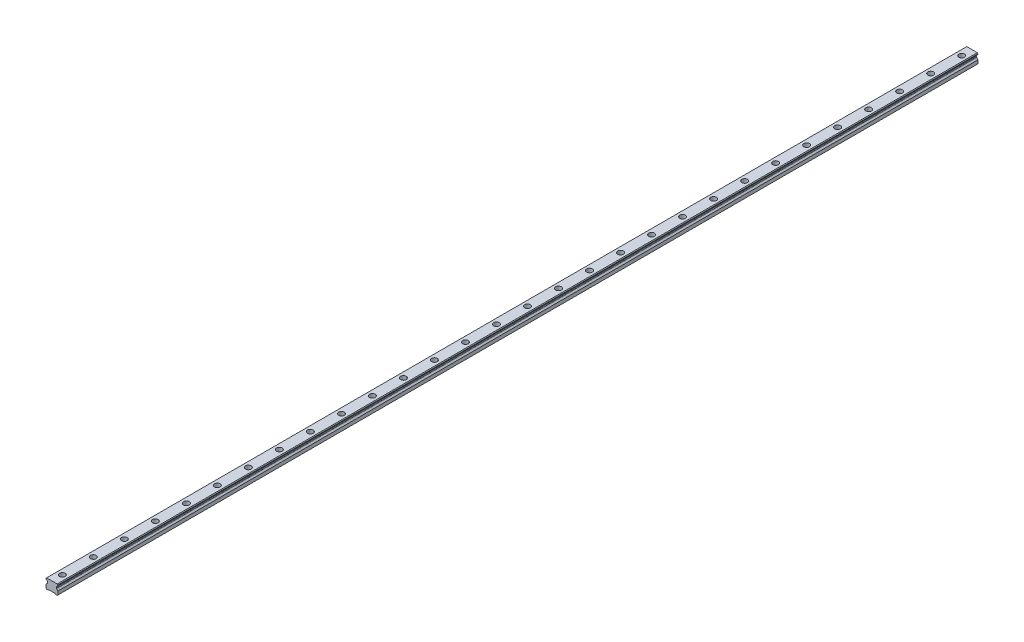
ISO-10303-21;
HEADER;
FILE_DESCRIPTION(('STEP AP214'),'2;1');
FILE_NAME('part.step','',(''),(''),'','','');
FILE_SCHEMA(('AUTOMOTIVE_DESIGN { 1 0 10303 214 1 1 1 1 }'));
ENDSEC;
DATA;
#1=APPLICATION_CONTEXT('core data for automotive mechanical design processes');
#2=APPLICATION_PROTOCOL_DEFINITION('international standard','automotive_design',2000,#1);
#3=PRODUCT_CONTEXT('',#1,'mechanical');
#4=PRODUCT('Part','Part','',(#3));
#5=PRODUCT_RELATED_PRODUCT_CATEGORY('part','',(#4));
#6=PRODUCT_DEFINITION_FORMATION('','',#4);
#7=PRODUCT_DEFINITION_CONTEXT('part definition',#1,'design');
#8=PRODUCT_DEFINITION('design','',#6,#7);
#9=PRODUCT_DEFINITION_SHAPE('','',#8);
#10=(LENGTH_UNIT() NAMED_UNIT(*) SI_UNIT(.MILLI.,.METRE.));
#11=(NAMED_UNIT(*) PLANE_ANGLE_UNIT() SI_UNIT($,.RADIAN.));
#12=(NAMED_UNIT(*) SI_UNIT($,.STERADIAN.) SOLID_ANGLE_UNIT());
#13=UNCERTAINTY_MEASURE_WITH_UNIT(LENGTH_MEASURE(1.E-05),#10,'distance_accuracy_value','');
#14=(GEOMETRIC_REPRESENTATION_CONTEXT(3) GLOBAL_UNCERTAINTY_ASSIGNED_CONTEXT((#13)) GLOBAL_UNIT_ASSIGNED_CONTEXT((#10,
#11,#12)) REPRESENTATION_CONTEXT('',''));
#15=CARTESIAN_POINT('',(0.,0.,0.));
#16=DIRECTION('',(0.,0.,1.));
#17=DIRECTION('',(1.,0.,0.));
#18=AXIS2_PLACEMENT_3D('',#15,#16,#17);
#19=CARTESIAN_POINT('',(0.,10.2,-870.));
#20=DIRECTION('',(0.,1.,0.));
#21=DIRECTION('',(0.,0.,1.));
#22=AXIS2_PLACEMENT_3D('',#19,#20,#21);
#23=PLANE('',#22);
#24=CARTESIAN_POINT('',(0.,10.2,-870.));
#25=DIRECTION('',(0.,1.,0.));
#26=DIRECTION('',(0.,0.,1.));
#27=AXIS2_PLACEMENT_3D('',#24,#25,#26);
#28=CIRCLE('',#27,3.5);
#29=CARTESIAN_POINT('',(0.,10.2,-866.5));
#30=VERTEX_POINT('',#29);
#31=EDGE_CURVE('E581',#30,#30,#28,.T.);
#32=ORIENTED_EDGE('',*,*,#31,.F.);
#33=EDGE_LOOP('',(#32));
#34=FACE_BOUND('',#33,.T.);
#35=CARTESIAN_POINT('',(0.,10.2,-870.));
#36=DIRECTION('',(0.,1.,0.));
#37=DIRECTION('',(0.,0.,1.));
#38=AXIS2_PLACEMENT_3D('',#35,#36,#37);
#39=CIRCLE('',#38,5.5);
#40=CARTESIAN_POINT('',(0.,10.2,-864.5));
#41=VERTEX_POINT('',#40);
#42=EDGE_CURVE('E11',#41,#41,#39,.T.);
#43=ORIENTED_EDGE('',*,*,#42,.T.);
#44=EDGE_LOOP('',(#43));
#45=FACE_BOUND('',#44,.T.);
#46=ADVANCED_FACE('F39',(#34,#45),#23,.T.);
#47=CARTESIAN_POINT('',(0.,10.2,-870.));
#48=DIRECTION('',(0.,1.,0.));
#49=DIRECTION('',(0.,0.,1.));
#50=AXIS2_PLACEMENT_3D('',#47,#48,#49);
#51=CYLINDRICAL_SURFACE('',#50,5.5);
#52=ORIENTED_EDGE('',*,*,#42,.F.);
#53=EDGE_LOOP('',(#52));
#54=FACE_BOUND('',#53,.T.);
#55=CARTESIAN_POINT('',(0.,19.2,-870.));
#56=DIRECTION('',(0.,1.,0.));
#57=DIRECTION('',(0.,0.,1.));
#58=AXIS2_PLACEMENT_3D('',#55,#56,#57);
#59=CIRCLE('',#58,5.5);
#60=CARTESIAN_POINT('',(0.,19.2,-864.5));
#61=VERTEX_POINT('',#60);
#62=EDGE_CURVE('E48',#61,#61,#59,.T.);
#63=ORIENTED_EDGE('',*,*,#62,.T.);
#64=EDGE_LOOP('',(#63));
#65=FACE_BOUND('',#64,.T.);
#66=ADVANCED_FACE('F1028',(#54,#65),#51,.F.);
#67=CARTESIAN_POINT('',(0.,10.2,-810.));
#68=DIRECTION('',(0.,1.,0.));
#69=DIRECTION('',(0.,0.,1.));
#70=AXIS2_PLACEMENT_3D('',#67,#68,#69);
#71=PLANE('',#70);
#72=CARTESIAN_POINT('',(0.,10.2,-810.));
#73=DIRECTION('',(0.,1.,0.));
#74=DIRECTION('',(0.,0.,1.));
#75=AXIS2_PLACEMENT_3D('',#72,#73,#74);
#76=CIRCLE('',#75,3.5);
#77=CARTESIAN_POINT('',(0.,10.2,-806.5));
#78=VERTEX_POINT('',#77);
#79=EDGE_CURVE('E586',#78,#78,#76,.T.);
#80=ORIENTED_EDGE('',*,*,#79,.F.);
#81=EDGE_LOOP('',(#80));
#82=FACE_BOUND('',#81,.T.);
#83=CARTESIAN_POINT('',(0.,10.2,-810.));
#84=DIRECTION('',(0.,1.,0.));
#85=DIRECTION('',(0.,0.,1.));
#86=AXIS2_PLACEMENT_3D('',#83,#84,#85);
#87=CIRCLE('',#86,5.5);
#88=CARTESIAN_POINT('',(0.,10.2,-804.5));
#89=VERTEX_POINT('',#88);
#90=EDGE_CURVE('E565',#89,#89,#87,.T.);
#91=ORIENTED_EDGE('',*,*,#90,.T.);
#92=EDGE_LOOP('',(#91));
#93=FACE_BOUND('',#92,.T.);
#94=ADVANCED_FACE('F1030',(#82,#93),#71,.T.);
#95=CARTESIAN_POINT('',(0.,10.2,-810.));
#96=DIRECTION('',(0.,1.,0.));
#97=DIRECTION('',(0.,0.,1.));
#98=AXIS2_PLACEMENT_3D('',#95,#96,#97);
#99=CYLINDRICAL_SURFACE('',#98,5.5);
#100=ORIENTED_EDGE('',*,*,#90,.F.);
#101=EDGE_LOOP('',(#100));
#102=FACE_BOUND('',#101,.T.);
#103=CARTESIAN_POINT('',(0.,19.2,-810.));
#104=DIRECTION('',(0.,1.,0.));
#105=DIRECTION('',(0.,0.,1.));
#106=AXIS2_PLACEMENT_3D('',#103,#104,#105);
#107=CIRCLE('',#106,5.5);
#108=CARTESIAN_POINT('',(0.,19.2,-804.5));
#109=VERTEX_POINT('',#108);
#110=EDGE_CURVE('E561',#109,#109,#107,.T.);
#111=ORIENTED_EDGE('',*,*,#110,.T.);
#112=EDGE_LOOP('',(#111));
#113=FACE_BOUND('',#112,.T.);
#114=ADVANCED_FACE('F1036',(#102,#113),#99,.F.);
#115=CARTESIAN_POINT('',(0.,10.2,-750.));
#116=DIRECTION('',(0.,1.,0.));
#117=DIRECTION('',(0.,0.,1.));
#118=AXIS2_PLACEMENT_3D('',#115,#116,#117);
#119=PLANE('',#118);
#120=CARTESIAN_POINT('',(0.,10.2,-750.));
#121=DIRECTION('',(0.,1.,0.));
#122=DIRECTION('',(0.,0.,1.));
#123=AXIS2_PLACEMENT_3D('',#120,#121,#122);
#124=CIRCLE('',#123,3.5);
#125=CARTESIAN_POINT('',(0.,10.2,-746.5));
#126=VERTEX_POINT('',#125);
#127=EDGE_CURVE('E591',#126,#126,#124,.T.);
#128=ORIENTED_EDGE('',*,*,#127,.F.);
#129=EDGE_LOOP('',(#128));
#130=FACE_BOUND('',#129,.T.);
#131=CARTESIAN_POINT('',(0.,10.2,-750.));
#132=DIRECTION('',(0.,1.,0.));
#133=DIRECTION('',(0.,0.,1.));
#134=AXIS2_PLACEMENT_3D('',#131,#132,#133);
#135=CIRCLE('',#134,5.5);
#136=CARTESIAN_POINT('',(0.,10.2,-744.5));
#137=VERTEX_POINT('',#136);
#138=EDGE_CURVE('E557',#137,#137,#135,.T.);
#139=ORIENTED_EDGE('',*,*,#138,.T.);
#140=EDGE_LOOP('',(#139));
#141=FACE_BOUND('',#140,.T.);
#142=ADVANCED_FACE('F1044',(#130,#141),#119,.T.);
#143=CARTESIAN_POINT('',(0.,10.2,-750.));
#144=DIRECTION('',(0.,1.,0.));
#145=DIRECTION('',(0.,0.,1.));
#146=AXIS2_PLACEMENT_3D('',#143,#144,#145);
#147=CYLINDRICAL_SURFACE('',#146,5.5);
#148=ORIENTED_EDGE('',*,*,#138,.F.);
#149=EDGE_LOOP('',(#148));
#150=FACE_BOUND('',#149,.T.);
#151=CARTESIAN_POINT('',(0.,19.2,-750.));
#152=DIRECTION('',(0.,1.,0.));
#153=DIRECTION('',(0.,0.,1.));
#154=AXIS2_PLACEMENT_3D('',#151,#152,#153);
#155=CIRCLE('',#154,5.5);
#156=CARTESIAN_POINT('',(0.,19.2,-744.5));
#157=VERTEX_POINT('',#156);
#158=EDGE_CURVE('E553',#157,#157,#155,.T.);
#159=ORIENTED_EDGE('',*,*,#158,.T.);
#160=EDGE_LOOP('',(#159));
#161=FACE_BOUND('',#160,.T.);
#162=ADVANCED_FACE('F1048',(#150,#161),#147,.F.);
#163=CARTESIAN_POINT('',(0.,10.2,-690.));
#164=DIRECTION('',(0.,1.,0.));
#165=DIRECTION('',(0.,0.,1.));
#166=AXIS2_PLACEMENT_3D('',#163,#164,#165);
#167=PLANE('',#166);
#168=CARTESIAN_POINT('',(0.,10.2,-690.));
#169=DIRECTION('',(0.,1.,0.));
#170=DIRECTION('',(0.,0.,1.));
#171=AXIS2_PLACEMENT_3D('',#168,#169,#170);
#172=CIRCLE('',#171,3.5);
#173=CARTESIAN_POINT('',(0.,10.2,-686.5));
#174=VERTEX_POINT('',#173);
#175=EDGE_CURVE('E596',#174,#174,#172,.T.);
#176=ORIENTED_EDGE('',*,*,#175,.F.);
#177=EDGE_LOOP('',(#176));
#178=FACE_BOUND('',#177,.T.);
#179=CARTESIAN_POINT('',(0.,10.2,-690.));
#180=DIRECTION('',(0.,1.,0.));
#181=DIRECTION('',(0.,0.,1.));
#182=AXIS2_PLACEMENT_3D('',#179,#180,#181);
#183=CIRCLE('',#182,5.5);
#184=CARTESIAN_POINT('',(0.,10.2,-684.5));
#185=VERTEX_POINT('',#184);
#186=EDGE_CURVE('E549',#185,#185,#183,.T.);
#187=ORIENTED_EDGE('',*,*,#186,.T.);
#188=EDGE_LOOP('',(#187));
#189=FACE_BOUND('',#188,.T.);
#190=ADVANCED_FACE('F1052',(#178,#189),#167,.T.);
#191=CARTESIAN_POINT('',(0.,10.2,-690.));
#192=DIRECTION('',(0.,1.,0.));
#193=DIRECTION('',(0.,0.,1.));
#194=AXIS2_PLACEMENT_3D('',#191,#192,#193);
#195=CYLINDRICAL_SURFACE('',#194,5.5);
#196=ORIENTED_EDGE('',*,*,#186,.F.);
#197=EDGE_LOOP('',(#196));
#198=FACE_BOUND('',#197,.T.);
#199=CARTESIAN_POINT('',(0.,19.2,-690.));
#200=DIRECTION('',(0.,1.,0.));
#201=DIRECTION('',(0.,0.,1.));
#202=AXIS2_PLACEMENT_3D('',#199,#200,#201);
#203=CIRCLE('',#202,5.5);
#204=CARTESIAN_POINT('',(0.,19.2,-684.5));
#205=VERTEX_POINT('',#204);
#206=EDGE_CURVE('E545',#205,#205,#203,.T.);
#207=ORIENTED_EDGE('',*,*,#206,.T.);
#208=EDGE_LOOP('',(#207));
#209=FACE_BOUND('',#208,.T.);
#210=ADVANCED_FACE('F1056',(#198,#209),#195,.F.);
#211=CARTESIAN_POINT('',(0.,10.2,-630.));
#212=DIRECTION('',(0.,1.,0.));
#213=DIRECTION('',(0.,0.,1.));
#214=AXIS2_PLACEMENT_3D('',#211,#212,#213);
#215=PLANE('',#214);
#216=CARTESIAN_POINT('',(0.,10.2,-630.));
#217=DIRECTION('',(0.,1.,0.));
#218=DIRECTION('',(0.,0.,1.));
#219=AXIS2_PLACEMENT_3D('',#216,#217,#218);
#220=CIRCLE('',#219,3.5);
#221=CARTESIAN_POINT('',(0.,10.2,-626.5));
#222=VERTEX_POINT('',#221);
#223=EDGE_CURVE('E601',#222,#222,#220,.T.);
#224=ORIENTED_EDGE('',*,*,#223,.F.);
#225=EDGE_LOOP('',(#224));
#226=FACE_BOUND('',#225,.T.);
#227=CARTESIAN_POINT('',(0.,10.2,-630.));
#228=DIRECTION('',(0.,1.,0.));
#229=DIRECTION('',(0.,0.,1.));
#230=AXIS2_PLACEMENT_3D('',#227,#228,#229);
#231=CIRCLE('',#230,5.5);
#232=CARTESIAN_POINT('',(0.,10.2,-624.5));
#233=VERTEX_POINT('',#232);
#234=EDGE_CURVE('E541',#233,#233,#231,.T.);
#235=ORIENTED_EDGE('',*,*,#234,.T.);
#236=EDGE_LOOP('',(#235));
#237=FACE_BOUND('',#236,.T.);
#238=ADVANCED_FACE('F1060',(#226,#237),#215,.T.);
#239=CARTESIAN_POINT('',(0.,10.2,-630.));
#240=DIRECTION('',(0.,1.,0.));
#241=DIRECTION('',(0.,0.,1.));
#242=AXIS2_PLACEMENT_3D('',#239,#240,#241);
#243=CYLINDRICAL_SURFACE('',#242,5.5);
#244=ORIENTED_EDGE('',*,*,#234,.F.);
#245=EDGE_LOOP('',(#244));
#246=FACE_BOUND('',#245,.T.);
#247=CARTESIAN_POINT('',(0.,19.2,-630.));
#248=DIRECTION('',(0.,1.,0.));
#249=DIRECTION('',(0.,0.,1.));
#250=AXIS2_PLACEMENT_3D('',#247,#248,#249);
#251=CIRCLE('',#250,5.5);
#252=CARTESIAN_POINT('',(0.,19.2,-624.5));
#253=VERTEX_POINT('',#252);
#254=EDGE_CURVE('E537',#253,#253,#251,.T.);
#255=ORIENTED_EDGE('',*,*,#254,.T.);
#256=EDGE_LOOP('',(#255));
#257=FACE_BOUND('',#256,.T.);
#258=ADVANCED_FACE('F1064',(#246,#257),#243,.F.);
#259=CARTESIAN_POINT('',(0.,10.2,-570.));
#260=DIRECTION('',(0.,1.,0.));
#261=DIRECTION('',(0.,0.,1.));
#262=AXIS2_PLACEMENT_3D('',#259,#260,#261);
#263=PLANE('',#262);
#264=CARTESIAN_POINT('',(0.,10.2,-570.));
#265=DIRECTION('',(0.,1.,0.));
#266=DIRECTION('',(0.,0.,1.));
#267=AXIS2_PLACEMENT_3D('',#264,#265,#266);
#268=CIRCLE('',#267,3.5);
#269=CARTESIAN_POINT('',(0.,10.2,-566.5));
#270=VERTEX_POINT('',#269);
#271=EDGE_CURVE('E606',#270,#270,#268,.T.);
#272=ORIENTED_EDGE('',*,*,#271,.F.);
#273=EDGE_LOOP('',(#272));
#274=FACE_BOUND('',#273,.T.);
#275=CARTESIAN_POINT('',(0.,10.2,-570.));
#276=DIRECTION('',(0.,1.,0.));
#277=DIRECTION('',(0.,0.,1.));
#278=AXIS2_PLACEMENT_3D('',#275,#276,#277);
#279=CIRCLE('',#278,5.5);
#280=CARTESIAN_POINT('',(0.,10.2,-564.5));
#281=VERTEX_POINT('',#280);
#282=EDGE_CURVE('E533',#281,#281,#279,.T.);
#283=ORIENTED_EDGE('',*,*,#282,.T.);
#284=EDGE_LOOP('',(#283));
#285=FACE_BOUND('',#284,.T.);
#286=ADVANCED_FACE('F1068',(#274,#285),#263,.T.);
#287=CARTESIAN_POINT('',(0.,10.2,-570.));
#288=DIRECTION('',(0.,1.,0.));
#289=DIRECTION('',(0.,0.,1.));
#290=AXIS2_PLACEMENT_3D('',#287,#288,#289);
#291=CYLINDRICAL_SURFACE('',#290,5.5);
#292=ORIENTED_EDGE('',*,*,#282,.F.);
#293=EDGE_LOOP('',(#292));
#294=FACE_BOUND('',#293,.T.);
#295=CARTESIAN_POINT('',(0.,19.2,-570.));
#296=DIRECTION('',(0.,1.,0.));
#297=DIRECTION('',(0.,0.,1.));
#298=AXIS2_PLACEMENT_3D('',#295,#296,#297);
#299=CIRCLE('',#298,5.5);
#300=CARTESIAN_POINT('',(0.,19.2,-564.5));
#301=VERTEX_POINT('',#300);
#302=EDGE_CURVE('E529',#301,#301,#299,.T.);
#303=ORIENTED_EDGE('',*,*,#302,.T.);
#304=EDGE_LOOP('',(#303));
#305=FACE_BOUND('',#304,.T.);
#306=ADVANCED_FACE('F1072',(#294,#305),#291,.F.);
#307=CARTESIAN_POINT('',(0.,10.2,-510.));
#308=DIRECTION('',(0.,1.,0.));
#309=DIRECTION('',(0.,0.,1.));
#310=AXIS2_PLACEMENT_3D('',#307,#308,#309);
#311=PLANE('',#310);
#312=CARTESIAN_POINT('',(0.,10.2,-510.));
#313=DIRECTION('',(0.,1.,0.));
#314=DIRECTION('',(0.,0.,1.));
#315=AXIS2_PLACEMENT_3D('',#312,#313,#314);
#316=CIRCLE('',#315,3.5);
#317=CARTESIAN_POINT('',(0.,10.2,-506.5));
#318=VERTEX_POINT('',#317);
#319=EDGE_CURVE('E611',#318,#318,#316,.T.);
#320=ORIENTED_EDGE('',*,*,#319,.F.);
#321=EDGE_LOOP('',(#320));
#322=FACE_BOUND('',#321,.T.);
#323=CARTESIAN_POINT('',(0.,10.2,-510.));
#324=DIRECTION('',(0.,1.,0.));
#325=DIRECTION('',(0.,0.,1.));
#326=AXIS2_PLACEMENT_3D('',#323,#324,#325);
#327=CIRCLE('',#326,5.5);
#328=CARTESIAN_POINT('',(0.,10.2,-504.5));
#329=VERTEX_POINT('',#328);
#330=EDGE_CURVE('E525',#329,#329,#327,.T.);
#331=ORIENTED_EDGE('',*,*,#330,.T.);
#332=EDGE_LOOP('',(#331));
#333=FACE_BOUND('',#332,.T.);
#334=ADVANCED_FACE('F1076',(#322,#333),#311,.T.);
#335=CARTESIAN_POINT('',(0.,10.2,-510.));
#336=DIRECTION('',(0.,1.,0.));
#337=DIRECTION('',(0.,0.,1.));
#338=AXIS2_PLACEMENT_3D('',#335,#336,#337);
#339=CYLINDRICAL_SURFACE('',#338,5.5);
#340=ORIENTED_EDGE('',*,*,#330,.F.);
#341=EDGE_LOOP('',(#340));
#342=FACE_BOUND('',#341,.T.);
#343=CARTESIAN_POINT('',(0.,19.2,-510.));
#344=DIRECTION('',(0.,1.,0.));
#345=DIRECTION('',(0.,0.,1.));
#346=AXIS2_PLACEMENT_3D('',#343,#344,#345);
#347=CIRCLE('',#346,5.5);
#348=CARTESIAN_POINT('',(0.,19.2,-504.5));
#349=VERTEX_POINT('',#348);
#350=EDGE_CURVE('E521',#349,#349,#347,.T.);
#351=ORIENTED_EDGE('',*,*,#350,.T.);
#352=EDGE_LOOP('',(#351));
#353=FACE_BOUND('',#352,.T.);
#354=ADVANCED_FACE('F1080',(#342,#353),#339,.F.);
#355=CARTESIAN_POINT('',(0.,10.2,-450.));
#356=DIRECTION('',(0.,1.,0.));
#357=DIRECTION('',(0.,0.,1.));
#358=AXIS2_PLACEMENT_3D('',#355,#356,#357);
#359=PLANE('',#358);
#360=CARTESIAN_POINT('',(0.,10.2,-450.));
#361=DIRECTION('',(0.,1.,0.));
#362=DIRECTION('',(0.,0.,1.));
#363=AXIS2_PLACEMENT_3D('',#360,#361,#362);
#364=CIRCLE('',#363,3.5);
#365=CARTESIAN_POINT('',(0.,10.2,-446.5));
#366=VERTEX_POINT('',#365);
#367=EDGE_CURVE('E616',#366,#366,#364,.T.);
#368=ORIENTED_EDGE('',*,*,#367,.F.);
#369=EDGE_LOOP('',(#368));
#370=FACE_BOUND('',#369,.T.);
#371=CARTESIAN_POINT('',(0.,10.2,-450.));
#372=DIRECTION('',(0.,1.,0.));
#373=DIRECTION('',(0.,0.,1.));
#374=AXIS2_PLACEMENT_3D('',#371,#372,#373);
#375=CIRCLE('',#374,5.5);
#376=CARTESIAN_POINT('',(0.,10.2,-444.5));
#377=VERTEX_POINT('',#376);
#378=EDGE_CURVE('E517',#377,#377,#375,.T.);
#379=ORIENTED_EDGE('',*,*,#378,.T.);
#380=EDGE_LOOP('',(#379));
#381=FACE_BOUND('',#380,.T.);
#382=ADVANCED_FACE('F1084',(#370,#381),#359,.T.);
#383=CARTESIAN_POINT('',(0.,10.2,-450.));
#384=DIRECTION('',(0.,1.,0.));
#385=DIRECTION('',(0.,0.,1.));
#386=AXIS2_PLACEMENT_3D('',#383,#384,#385);
#387=CYLINDRICAL_SURFACE('',#386,5.5);
#388=ORIENTED_EDGE('',*,*,#378,.F.);
#389=EDGE_LOOP('',(#388));
#390=FACE_BOUND('',#389,.T.);
#391=CARTESIAN_POINT('',(0.,19.2,-450.));
#392=DIRECTION('',(0.,1.,0.));
#393=DIRECTION('',(0.,0.,1.));
#394=AXIS2_PLACEMENT_3D('',#391,#392,#393);
#395=CIRCLE('',#394,5.5);
#396=CARTESIAN_POINT('',(0.,19.2,-444.5));
#397=VERTEX_POINT('',#396);
#398=EDGE_CURVE('E513',#397,#397,#395,.T.);
#399=ORIENTED_EDGE('',*,*,#398,.T.);
#400=EDGE_LOOP('',(#399));
#401=FACE_BOUND('',#400,.T.);
#402=ADVANCED_FACE('F1088',(#390,#401),#387,.F.);
#403=CARTESIAN_POINT('',(0.,10.2,-390.));
#404=DIRECTION('',(0.,1.,0.));
#405=DIRECTION('',(0.,0.,1.));
#406=AXIS2_PLACEMENT_3D('',#403,#404,#405);
#407=PLANE('',#406);
#408=CARTESIAN_POINT('',(0.,10.2,-390.));
#409=DIRECTION('',(0.,1.,0.));
#410=DIRECTION('',(0.,0.,1.));
#411=AXIS2_PLACEMENT_3D('',#408,#409,#410);
#412=CIRCLE('',#411,3.5);
#413=CARTESIAN_POINT('',(0.,10.2,-386.5));
#414=VERTEX_POINT('',#413);
#415=EDGE_CURVE('E621',#414,#414,#412,.T.);
#416=ORIENTED_EDGE('',*,*,#415,.F.);
#417=EDGE_LOOP('',(#416));
#418=FACE_BOUND('',#417,.T.);
#419=CARTESIAN_POINT('',(0.,10.2,-390.));
#420=DIRECTION('',(0.,1.,0.));
#421=DIRECTION('',(0.,0.,1.));
#422=AXIS2_PLACEMENT_3D('',#419,#420,#421);
#423=CIRCLE('',#422,5.5);
#424=CARTESIAN_POINT('',(0.,10.2,-384.5));
#425=VERTEX_POINT('',#424);
#426=EDGE_CURVE('E509',#425,#425,#423,.T.);
#427=ORIENTED_EDGE('',*,*,#426,.T.);
#428=EDGE_LOOP('',(#427));
#429=FACE_BOUND('',#428,.T.);
#430=ADVANCED_FACE('F1092',(#418,#429),#407,.T.);
#431=CARTESIAN_POINT('',(0.,10.2,-390.));
#432=DIRECTION('',(0.,1.,0.));
#433=DIRECTION('',(0.,0.,1.));
#434=AXIS2_PLACEMENT_3D('',#431,#432,#433);
#435=CYLINDRICAL_SURFACE('',#434,5.5);
#436=ORIENTED_EDGE('',*,*,#426,.F.);
#437=EDGE_LOOP('',(#436));
#438=FACE_BOUND('',#437,.T.);
#439=CARTESIAN_POINT('',(0.,19.2,-390.));
#440=DIRECTION('',(0.,1.,0.));
#441=DIRECTION('',(0.,0.,1.));
#442=AXIS2_PLACEMENT_3D('',#439,#440,#441);
#443=CIRCLE('',#442,5.5);
#444=CARTESIAN_POINT('',(0.,19.2,-384.5));
#445=VERTEX_POINT('',#444);
#446=EDGE_CURVE('E505',#445,#445,#443,.T.);
#447=ORIENTED_EDGE('',*,*,#446,.T.);
#448=EDGE_LOOP('',(#447));
#449=FACE_BOUND('',#448,.T.);
#450=ADVANCED_FACE('F1096',(#438,#449),#435,.F.);
#451=CARTESIAN_POINT('',(0.,10.2,-330.));
#452=DIRECTION('',(0.,1.,0.));
#453=DIRECTION('',(0.,0.,1.));
#454=AXIS2_PLACEMENT_3D('',#451,#452,#453);
#455=PLANE('',#454);
#456=CARTESIAN_POINT('',(0.,10.2,-330.));
#457=DIRECTION('',(0.,1.,0.));
#458=DIRECTION('',(0.,0.,1.));
#459=AXIS2_PLACEMENT_3D('',#456,#457,#458);
#460=CIRCLE('',#459,3.5);
#461=CARTESIAN_POINT('',(0.,10.2,-326.5));
#462=VERTEX_POINT('',#461);
#463=EDGE_CURVE('E626',#462,#462,#460,.T.);
#464=ORIENTED_EDGE('',*,*,#463,.F.);
#465=EDGE_LOOP('',(#464));
#466=FACE_BOUND('',#465,.T.);
#467=CARTESIAN_POINT('',(0.,10.2,-330.));
#468=DIRECTION('',(0.,1.,0.));
#469=DIRECTION('',(0.,0.,1.));
#470=AXIS2_PLACEMENT_3D('',#467,#468,#469);
#471=CIRCLE('',#470,5.5);
#472=CARTESIAN_POINT('',(0.,10.2,-324.5));
#473=VERTEX_POINT('',#472);
#474=EDGE_CURVE('E501',#473,#473,#471,.T.);
#475=ORIENTED_EDGE('',*,*,#474,.T.);
#476=EDGE_LOOP('',(#475));
#477=FACE_BOUND('',#476,.T.);
#478=ADVANCED_FACE('F1100',(#466,#477),#455,.T.);
#479=CARTESIAN_POINT('',(0.,10.2,-330.));
#480=DIRECTION('',(0.,1.,0.));
#481=DIRECTION('',(0.,0.,1.));
#482=AXIS2_PLACEMENT_3D('',#479,#480,#481);
#483=CYLINDRICAL_SURFACE('',#482,5.5);
#484=ORIENTED_EDGE('',*,*,#474,.F.);
#485=EDGE_LOOP('',(#484));
#486=FACE_BOUND('',#485,.T.);
#487=CARTESIAN_POINT('',(0.,19.2,-330.));
#488=DIRECTION('',(0.,1.,0.));
#489=DIRECTION('',(0.,0.,1.));
#490=AXIS2_PLACEMENT_3D('',#487,#488,#489);
#491=CIRCLE('',#490,5.5);
#492=CARTESIAN_POINT('',(0.,19.2,-324.5));
#493=VERTEX_POINT('',#492);
#494=EDGE_CURVE('E497',#493,#493,#491,.T.);
#495=ORIENTED_EDGE('',*,*,#494,.T.);
#496=EDGE_LOOP('',(#495));
#497=FACE_BOUND('',#496,.T.);
#498=ADVANCED_FACE('F1104',(#486,#497),#483,.F.);
#499=CARTESIAN_POINT('',(0.,10.2,-270.));
#500=DIRECTION('',(0.,1.,0.));
#501=DIRECTION('',(0.,0.,1.));
#502=AXIS2_PLACEMENT_3D('',#499,#500,#501);
#503=PLANE('',#502);
#504=CARTESIAN_POINT('',(0.,10.2,-270.));
#505=DIRECTION('',(0.,1.,0.));
#506=DIRECTION('',(0.,0.,1.));
#507=AXIS2_PLACEMENT_3D('',#504,#505,#506);
#508=CIRCLE('',#507,3.5);
#509=CARTESIAN_POINT('',(0.,10.2,-266.5));
#510=VERTEX_POINT('',#509);
#511=EDGE_CURVE('E631',#510,#510,#508,.T.);
#512=ORIENTED_EDGE('',*,*,#511,.F.);
#513=EDGE_LOOP('',(#512));
#514=FACE_BOUND('',#513,.T.);
#515=CARTESIAN_POINT('',(0.,10.2,-270.));
#516=DIRECTION('',(0.,1.,0.));
#517=DIRECTION('',(0.,0.,1.));
#518=AXIS2_PLACEMENT_3D('',#515,#516,#517);
#519=CIRCLE('',#518,5.5);
#520=CARTESIAN_POINT('',(0.,10.2,-264.5));
#521=VERTEX_POINT('',#520);
#522=EDGE_CURVE('E493',#521,#521,#519,.T.);
#523=ORIENTED_EDGE('',*,*,#522,.T.);
#524=EDGE_LOOP('',(#523));
#525=FACE_BOUND('',#524,.T.);
#526=ADVANCED_FACE('F1108',(#514,#525),#503,.T.);
#527=CARTESIAN_POINT('',(0.,10.2,-270.));
#528=DIRECTION('',(0.,1.,0.));
#529=DIRECTION('',(0.,0.,1.));
#530=AXIS2_PLACEMENT_3D('',#527,#528,#529);
#531=CYLINDRICAL_SURFACE('',#530,5.5);
#532=ORIENTED_EDGE('',*,*,#522,.F.);
#533=EDGE_LOOP('',(#532));
#534=FACE_BOUND('',#533,.T.);
#535=CARTESIAN_POINT('',(0.,19.2,-270.));
#536=DIRECTION('',(0.,1.,0.));
#537=DIRECTION('',(0.,0.,1.));
#538=AXIS2_PLACEMENT_3D('',#535,#536,#537);
#539=CIRCLE('',#538,5.5);
#540=CARTESIAN_POINT('',(0.,19.2,-264.5));
#541=VERTEX_POINT('',#540);
#542=EDGE_CURVE('E489',#541,#541,#539,.T.);
#543=ORIENTED_EDGE('',*,*,#542,.T.);
#544=EDGE_LOOP('',(#543));
#545=FACE_BOUND('',#544,.T.);
#546=ADVANCED_FACE('F1112',(#534,#545),#531,.F.);
#547=CARTESIAN_POINT('',(0.,10.2,-210.));
#548=DIRECTION('',(0.,1.,0.));
#549=DIRECTION('',(0.,0.,1.));
#550=AXIS2_PLACEMENT_3D('',#547,#548,#549);
#551=PLANE('',#550);
#552=CARTESIAN_POINT('',(0.,10.2,-210.));
#553=DIRECTION('',(0.,1.,0.));
#554=DIRECTION('',(0.,0.,1.));
#555=AXIS2_PLACEMENT_3D('',#552,#553,#554);
#556=CIRCLE('',#555,3.5);
#557=CARTESIAN_POINT('',(0.,10.2,-206.5));
#558=VERTEX_POINT('',#557);
#559=EDGE_CURVE('E636',#558,#558,#556,.T.);
#560=ORIENTED_EDGE('',*,*,#559,.F.);
#561=EDGE_LOOP('',(#560));
#562=FACE_BOUND('',#561,.T.);
#563=CARTESIAN_POINT('',(0.,10.2,-210.));
#564=DIRECTION('',(0.,1.,0.));
#565=DIRECTION('',(0.,0.,1.));
#566=AXIS2_PLACEMENT_3D('',#563,#564,#565);
#567=CIRCLE('',#566,5.5);
#568=CARTESIAN_POINT('',(0.,10.2,-204.5));
#569=VERTEX_POINT('',#568);
#570=EDGE_CURVE('E485',#569,#569,#567,.T.);
#571=ORIENTED_EDGE('',*,*,#570,.T.);
#572=EDGE_LOOP('',(#571));
#573=FACE_BOUND('',#572,.T.);
#574=ADVANCED_FACE('F1116',(#562,#573),#551,.T.);
#575=CARTESIAN_POINT('',(0.,10.2,-210.));
#576=DIRECTION('',(0.,1.,0.));
#577=DIRECTION('',(0.,0.,1.));
#578=AXIS2_PLACEMENT_3D('',#575,#576,#577);
#579=CYLINDRICAL_SURFACE('',#578,5.5);
#580=ORIENTED_EDGE('',*,*,#570,.F.);
#581=EDGE_LOOP('',(#580));
#582=FACE_BOUND('',#581,.T.);
#583=CARTESIAN_POINT('',(0.,19.2,-210.));
#584=DIRECTION('',(0.,1.,0.));
#585=DIRECTION('',(0.,0.,1.));
#586=AXIS2_PLACEMENT_3D('',#583,#584,#585);
#587=CIRCLE('',#586,5.5);
#588=CARTESIAN_POINT('',(0.,19.2,-204.5));
#589=VERTEX_POINT('',#588);
#590=EDGE_CURVE('E481',#589,#589,#587,.T.);
#591=ORIENTED_EDGE('',*,*,#590,.T.);
#592=EDGE_LOOP('',(#591));
#593=FACE_BOUND('',#592,.T.);
#594=ADVANCED_FACE('F1120',(#582,#593),#579,.F.);
#595=CARTESIAN_POINT('',(0.,10.2,-150.));
#596=DIRECTION('',(0.,1.,0.));
#597=DIRECTION('',(0.,0.,1.));
#598=AXIS2_PLACEMENT_3D('',#595,#596,#597);
#599=PLANE('',#598);
#600=CARTESIAN_POINT('',(0.,10.2,-150.));
#601=DIRECTION('',(0.,1.,0.));
#602=DIRECTION('',(0.,0.,1.));
#603=AXIS2_PLACEMENT_3D('',#600,#601,#602);
#604=CIRCLE('',#603,3.5);
#605=CARTESIAN_POINT('',(0.,10.2,-146.5));
#606=VERTEX_POINT('',#605);
#607=EDGE_CURVE('E641',#606,#606,#604,.T.);
#608=ORIENTED_EDGE('',*,*,#607,.F.);
#609=EDGE_LOOP('',(#608));
#610=FACE_BOUND('',#609,.T.);
#611=CARTESIAN_POINT('',(0.,10.2,-150.));
#612=DIRECTION('',(0.,1.,0.));
#613=DIRECTION('',(0.,0.,1.));
#614=AXIS2_PLACEMENT_3D('',#611,#612,#613);
#615=CIRCLE('',#614,5.5);
#616=CARTESIAN_POINT('',(0.,10.2,-144.5));
#617=VERTEX_POINT('',#616);
#618=EDGE_CURVE('E477',#617,#617,#615,.T.);
#619=ORIENTED_EDGE('',*,*,#618,.T.);
#620=EDGE_LOOP('',(#619));
#621=FACE_BOUND('',#620,.T.);
#622=ADVANCED_FACE('F1124',(#610,#621),#599,.T.);
#623=CARTESIAN_POINT('',(0.,10.2,-150.));
#624=DIRECTION('',(0.,1.,0.));
#625=DIRECTION('',(0.,0.,1.));
#626=AXIS2_PLACEMENT_3D('',#623,#624,#625);
#627=CYLINDRICAL_SURFACE('',#626,5.5);
#628=ORIENTED_EDGE('',*,*,#618,.F.);
#629=EDGE_LOOP('',(#628));
#630=FACE_BOUND('',#629,.T.);
#631=CARTESIAN_POINT('',(0.,19.2,-150.));
#632=DIRECTION('',(0.,1.,0.));
#633=DIRECTION('',(0.,0.,1.));
#634=AXIS2_PLACEMENT_3D('',#631,#632,#633);
#635=CIRCLE('',#634,5.5);
#636=CARTESIAN_POINT('',(0.,19.2,-144.5));
#637=VERTEX_POINT('',#636);
#638=EDGE_CURVE('E473',#637,#637,#635,.T.);
#639=ORIENTED_EDGE('',*,*,#638,.T.);
#640=EDGE_LOOP('',(#639));
#641=FACE_BOUND('',#640,.T.);
#642=ADVANCED_FACE('F1128',(#630,#641),#627,.F.);
#643=CARTESIAN_POINT('',(0.,10.2,-89.9999999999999));
#644=DIRECTION('',(0.,1.,0.));
#645=DIRECTION('',(0.,0.,1.));
#646=AXIS2_PLACEMENT_3D('',#643,#644,#645);
#647=PLANE('',#646);
#648=CARTESIAN_POINT('',(0.,10.2,-90.));
#649=DIRECTION('',(0.,1.,0.));
#650=DIRECTION('',(0.,0.,1.));
#651=AXIS2_PLACEMENT_3D('',#648,#649,#650);
#652=CIRCLE('',#651,3.5);
#653=CARTESIAN_POINT('',(0.,10.2,-86.5));
#654=VERTEX_POINT('',#653);
#655=EDGE_CURVE('E646',#654,#654,#652,.T.);
#656=ORIENTED_EDGE('',*,*,#655,.F.);
#657=EDGE_LOOP('',(#656));
#658=FACE_BOUND('',#657,.T.);
#659=CARTESIAN_POINT('',(0.,10.2,-89.9999999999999));
#660=DIRECTION('',(0.,1.,0.));
#661=DIRECTION('',(0.,0.,1.));
#662=AXIS2_PLACEMENT_3D('',#659,#660,#661);
#663=CIRCLE('',#662,5.5);
#664=CARTESIAN_POINT('',(0.,10.2,-84.4999999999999));
#665=VERTEX_POINT('',#664);
#666=EDGE_CURVE('E469',#665,#665,#663,.T.);
#667=ORIENTED_EDGE('',*,*,#666,.T.);
#668=EDGE_LOOP('',(#667));
#669=FACE_BOUND('',#668,.T.);
#670=ADVANCED_FACE('F1132',(#658,#669),#647,.T.);
#671=CARTESIAN_POINT('',(0.,10.2,-89.9999999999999));
#672=DIRECTION('',(0.,1.,0.));
#673=DIRECTION('',(0.,0.,1.));
#674=AXIS2_PLACEMENT_3D('',#671,#672,#673);
#675=CYLINDRICAL_SURFACE('',#674,5.5);
#676=ORIENTED_EDGE('',*,*,#666,.F.);
#677=EDGE_LOOP('',(#676));
#678=FACE_BOUND('',#677,.T.);
#679=CARTESIAN_POINT('',(0.,19.2,-89.9999999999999));
#680=DIRECTION('',(0.,1.,0.));
#681=DIRECTION('',(0.,0.,1.));
#682=AXIS2_PLACEMENT_3D('',#679,#680,#681);
#683=CIRCLE('',#682,5.5);
#684=CARTESIAN_POINT('',(0.,19.2,-84.4999999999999));
#685=VERTEX_POINT('',#684);
#686=EDGE_CURVE('E465',#685,#685,#683,.T.);
#687=ORIENTED_EDGE('',*,*,#686,.T.);
#688=EDGE_LOOP('',(#687));
#689=FACE_BOUND('',#688,.T.);
#690=ADVANCED_FACE('F1136',(#678,#689),#675,.F.);
#691=CARTESIAN_POINT('',(0.,10.2,-29.9999999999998));
#692=DIRECTION('',(0.,1.,0.));
#693=DIRECTION('',(0.,0.,1.));
#694=AXIS2_PLACEMENT_3D('',#691,#692,#693);
#695=PLANE('',#694);
#696=CARTESIAN_POINT('',(0.,10.2,-29.9999999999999));
#697=DIRECTION('',(0.,1.,0.));
#698=DIRECTION('',(0.,0.,1.));
#699=AXIS2_PLACEMENT_3D('',#696,#697,#698);
#700=CIRCLE('',#699,3.5);
#701=CARTESIAN_POINT('',(0.,10.2,-26.4999999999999));
#702=VERTEX_POINT('',#701);
#703=EDGE_CURVE('E651',#702,#702,#700,.T.);
#704=ORIENTED_EDGE('',*,*,#703,.F.);
#705=EDGE_LOOP('',(#704));
#706=FACE_BOUND('',#705,.T.);
#707=CARTESIAN_POINT('',(0.,10.2,-29.9999999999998));
#708=DIRECTION('',(0.,1.,0.));
#709=DIRECTION('',(0.,0.,1.));
#710=AXIS2_PLACEMENT_3D('',#707,#708,#709);
#711=CIRCLE('',#710,5.5);
#712=CARTESIAN_POINT('',(0.,10.2,-24.4999999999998));
#713=VERTEX_POINT('',#712);
#714=EDGE_CURVE('E461',#713,#713,#711,.T.);
#715=ORIENTED_EDGE('',*,*,#714,.T.);
#716=EDGE_LOOP('',(#715));
#717=FACE_BOUND('',#716,.T.);
#718=ADVANCED_FACE('F1140',(#706,#717),#695,.T.);
#719=CARTESIAN_POINT('',(0.,10.2,-29.9999999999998));
#720=DIRECTION('',(0.,1.,0.));
#721=DIRECTION('',(0.,0.,1.));
#722=AXIS2_PLACEMENT_3D('',#719,#720,#721);
#723=CYLINDRICAL_SURFACE('',#722,5.5);
#724=ORIENTED_EDGE('',*,*,#714,.F.);
#725=EDGE_LOOP('',(#724));
#726=FACE_BOUND('',#725,.T.);
#727=CARTESIAN_POINT('',(0.,19.2,-29.9999999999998));
#728=DIRECTION('',(0.,1.,0.));
#729=DIRECTION('',(0.,0.,1.));
#730=AXIS2_PLACEMENT_3D('',#727,#728,#729);
#731=CIRCLE('',#730,5.5);
#732=CARTESIAN_POINT('',(0.,19.2,-24.4999999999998));
#733=VERTEX_POINT('',#732);
#734=EDGE_CURVE('E457',#733,#733,#731,.T.);
#735=ORIENTED_EDGE('',*,*,#734,.T.);
#736=EDGE_LOOP('',(#735));
#737=FACE_BOUND('',#736,.T.);
#738=ADVANCED_FACE('F1144',(#726,#737),#723,.F.);
#739=CARTESIAN_POINT('',(0.,10.2,30.));
#740=DIRECTION('',(0.,1.,0.));
#741=DIRECTION('',(0.,0.,1.));
#742=AXIS2_PLACEMENT_3D('',#739,#740,#741);
#743=PLANE('',#742);
#744=CARTESIAN_POINT('',(0.,10.2,30.));
#745=DIRECTION('',(0.,1.,0.));
#746=DIRECTION('',(0.,0.,1.));
#747=AXIS2_PLACEMENT_3D('',#744,#745,#746);
#748=CIRCLE('',#747,3.5);
#749=CARTESIAN_POINT('',(0.,10.2,33.5));
#750=VERTEX_POINT('',#749);
#751=EDGE_CURVE('E656',#750,#750,#748,.T.);
#752=ORIENTED_EDGE('',*,*,#751,.F.);
#753=EDGE_LOOP('',(#752));
#754=FACE_BOUND('',#753,.T.);
#755=CARTESIAN_POINT('',(0.,10.2,30.));
#756=DIRECTION('',(0.,1.,0.));
#757=DIRECTION('',(0.,0.,1.));
#758=AXIS2_PLACEMENT_3D('',#755,#756,#757);
#759=CIRCLE('',#758,5.5);
#760=CARTESIAN_POINT('',(0.,10.2,35.5));
#761=VERTEX_POINT('',#760);
#762=EDGE_CURVE('E453',#761,#761,#759,.T.);
#763=ORIENTED_EDGE('',*,*,#762,.T.);
#764=EDGE_LOOP('',(#763));
#765=FACE_BOUND('',#764,.T.);
#766=ADVANCED_FACE('F1148',(#754,#765),#743,.T.);
#767=CARTESIAN_POINT('',(0.,10.2,30.));
#768=DIRECTION('',(0.,1.,0.));
#769=DIRECTION('',(0.,0.,1.));
#770=AXIS2_PLACEMENT_3D('',#767,#768,#769);
#771=CYLINDRICAL_SURFACE('',#770,5.5);
#772=ORIENTED_EDGE('',*,*,#762,.F.);
#773=EDGE_LOOP('',(#772));
#774=FACE_BOUND('',#773,.T.);
#775=CARTESIAN_POINT('',(0.,19.2,30.));
#776=DIRECTION('',(0.,1.,0.));
#777=DIRECTION('',(0.,0.,1.));
#778=AXIS2_PLACEMENT_3D('',#775,#776,#777);
#779=CIRCLE('',#778,5.5);
#780=CARTESIAN_POINT('',(0.,19.2,35.5));
#781=VERTEX_POINT('',#780);
#782=EDGE_CURVE('E449',#781,#781,#779,.T.);
#783=ORIENTED_EDGE('',*,*,#782,.T.);
#784=EDGE_LOOP('',(#783));
#785=FACE_BOUND('',#784,.T.);
#786=ADVANCED_FACE('F1152',(#774,#785),#771,.F.);
#787=CARTESIAN_POINT('',(0.,10.2,90.0000000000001));
#788=DIRECTION('',(0.,1.,0.));
#789=DIRECTION('',(0.,0.,1.));
#790=AXIS2_PLACEMENT_3D('',#787,#788,#789);
#791=PLANE('',#790);
#792=CARTESIAN_POINT('',(0.,10.2,90.));
#793=DIRECTION('',(0.,1.,0.));
#794=DIRECTION('',(0.,0.,1.));
#795=AXIS2_PLACEMENT_3D('',#792,#793,#794);
#796=CIRCLE('',#795,3.5);
#797=CARTESIAN_POINT('',(0.,10.2,93.5));
#798=VERTEX_POINT('',#797);
#799=EDGE_CURVE('E661',#798,#798,#796,.T.);
#800=ORIENTED_EDGE('',*,*,#799,.F.);
#801=EDGE_LOOP('',(#800));
#802=FACE_BOUND('',#801,.T.);
#803=CARTESIAN_POINT('',(0.,10.2,90.0000000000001));
#804=DIRECTION('',(0.,1.,0.));
#805=DIRECTION('',(0.,0.,1.));
#806=AXIS2_PLACEMENT_3D('',#803,#804,#805);
#807=CIRCLE('',#806,5.5);
#808=CARTESIAN_POINT('',(0.,10.2,95.5000000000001));
#809=VERTEX_POINT('',#808);
#810=EDGE_CURVE('E445',#809,#809,#807,.T.);
#811=ORIENTED_EDGE('',*,*,#810,.T.);
#812=EDGE_LOOP('',(#811));
#813=FACE_BOUND('',#812,.T.);
#814=ADVANCED_FACE('F1156',(#802,#813),#791,.T.);
#815=CARTESIAN_POINT('',(0.,10.2,90.0000000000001));
#816=DIRECTION('',(0.,1.,0.));
#817=DIRECTION('',(0.,0.,1.));
#818=AXIS2_PLACEMENT_3D('',#815,#816,#817);
#819=CYLINDRICAL_SURFACE('',#818,5.5);
#820=ORIENTED_EDGE('',*,*,#810,.F.);
#821=EDGE_LOOP('',(#820));
#822=FACE_BOUND('',#821,.T.);
#823=CARTESIAN_POINT('',(0.,19.2,90.0000000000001));
#824=DIRECTION('',(0.,1.,0.));
#825=DIRECTION('',(0.,0.,1.));
#826=AXIS2_PLACEMENT_3D('',#823,#824,#825);
#827=CIRCLE('',#826,5.5);
#828=CARTESIAN_POINT('',(0.,19.2,95.5000000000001));
#829=VERTEX_POINT('',#828);
#830=EDGE_CURVE('E441',#829,#829,#827,.T.);
#831=ORIENTED_EDGE('',*,*,#830,.T.);
#832=EDGE_LOOP('',(#831));
#833=FACE_BOUND('',#832,.T.);
#834=ADVANCED_FACE('F1160',(#822,#833),#819,.F.);
#835=CARTESIAN_POINT('',(0.,10.2,150.));
#836=DIRECTION('',(0.,1.,0.));
#837=DIRECTION('',(0.,0.,1.));
#838=AXIS2_PLACEMENT_3D('',#835,#836,#837);
#839=PLANE('',#838);
#840=CARTESIAN_POINT('',(0.,10.2,150.));
#841=DIRECTION('',(0.,1.,0.));
#842=DIRECTION('',(0.,0.,1.));
#843=AXIS2_PLACEMENT_3D('',#840,#841,#842);
#844=CIRCLE('',#843,3.5);
#845=CARTESIAN_POINT('',(0.,10.2,153.5));
#846=VERTEX_POINT('',#845);
#847=EDGE_CURVE('E666',#846,#846,#844,.T.);
#848=ORIENTED_EDGE('',*,*,#847,.F.);
#849=EDGE_LOOP('',(#848));
#850=FACE_BOUND('',#849,.T.);
#851=CARTESIAN_POINT('',(0.,10.2,150.));
#852=DIRECTION('',(0.,1.,0.));
#853=DIRECTION('',(0.,0.,1.));
#854=AXIS2_PLACEMENT_3D('',#851,#852,#853);
#855=CIRCLE('',#854,5.5);
#856=CARTESIAN_POINT('',(0.,10.2,155.5));
#857=VERTEX_POINT('',#856);
#858=EDGE_CURVE('E437',#857,#857,#855,.T.);
#859=ORIENTED_EDGE('',*,*,#858,.T.);
#860=EDGE_LOOP('',(#859));
#861=FACE_BOUND('',#860,.T.);
#862=ADVANCED_FACE('F1164',(#850,#861),#839,.T.);
#863=CARTESIAN_POINT('',(0.,10.2,150.));
#864=DIRECTION('',(0.,1.,0.));
#865=DIRECTION('',(0.,0.,1.));
#866=AXIS2_PLACEMENT_3D('',#863,#864,#865);
#867=CYLINDRICAL_SURFACE('',#866,5.5);
#868=ORIENTED_EDGE('',*,*,#858,.F.);
#869=EDGE_LOOP('',(#868));
#870=FACE_BOUND('',#869,.T.);
#871=CARTESIAN_POINT('',(0.,19.2,150.));
#872=DIRECTION('',(0.,1.,0.));
#873=DIRECTION('',(0.,0.,1.));
#874=AXIS2_PLACEMENT_3D('',#871,#872,#873);
#875=CIRCLE('',#874,5.5);
#876=CARTESIAN_POINT('',(0.,19.2,155.5));
#877=VERTEX_POINT('',#876);
#878=EDGE_CURVE('E433',#877,#877,#875,.T.);
#879=ORIENTED_EDGE('',*,*,#878,.T.);
#880=EDGE_LOOP('',(#879));
#881=FACE_BOUND('',#880,.T.);
#882=ADVANCED_FACE('F1168',(#870,#881),#867,.F.);
#883=CARTESIAN_POINT('',(0.,10.2,210.));
#884=DIRECTION('',(0.,1.,0.));
#885=DIRECTION('',(0.,0.,1.));
#886=AXIS2_PLACEMENT_3D('',#883,#884,#885);
#887=PLANE('',#886);
#888=CARTESIAN_POINT('',(0.,10.2,210.));
#889=DIRECTION('',(0.,1.,0.));
#890=DIRECTION('',(0.,0.,1.));
#891=AXIS2_PLACEMENT_3D('',#888,#889,#890);
#892=CIRCLE('',#891,3.5);
#893=CARTESIAN_POINT('',(0.,10.2,213.5));
#894=VERTEX_POINT('',#893);
#895=EDGE_CURVE('E671',#894,#894,#892,.T.);
#896=ORIENTED_EDGE('',*,*,#895,.F.);
#897=EDGE_LOOP('',(#896));
#898=FACE_BOUND('',#897,.T.);
#899=CARTESIAN_POINT('',(0.,10.2,210.));
#900=DIRECTION('',(0.,1.,0.));
#901=DIRECTION('',(0.,0.,1.));
#902=AXIS2_PLACEMENT_3D('',#899,#900,#901);
#903=CIRCLE('',#902,5.5);
#904=CARTESIAN_POINT('',(0.,10.2,215.5));
#905=VERTEX_POINT('',#904);
#906=EDGE_CURVE('E429',#905,#905,#903,.T.);
#907=ORIENTED_EDGE('',*,*,#906,.T.);
#908=EDGE_LOOP('',(#907));
#909=FACE_BOUND('',#908,.T.);
#910=ADVANCED_FACE('F1172',(#898,#909),#887,.T.);
#911=CARTESIAN_POINT('',(0.,10.2,210.));
#912=DIRECTION('',(0.,1.,0.));
#913=DIRECTION('',(0.,0.,1.));
#914=AXIS2_PLACEMENT_3D('',#911,#912,#913);
#915=CYLINDRICAL_SURFACE('',#914,5.5);
#916=ORIENTED_EDGE('',*,*,#906,.F.);
#917=EDGE_LOOP('',(#916));
#918=FACE_BOUND('',#917,.T.);
#919=CARTESIAN_POINT('',(0.,19.2,210.));
#920=DIRECTION('',(0.,1.,0.));
#921=DIRECTION('',(0.,0.,1.));
#922=AXIS2_PLACEMENT_3D('',#919,#920,#921);
#923=CIRCLE('',#922,5.5);
#924=CARTESIAN_POINT('',(0.,19.2,215.5));
#925=VERTEX_POINT('',#924);
#926=EDGE_CURVE('E425',#925,#925,#923,.T.);
#927=ORIENTED_EDGE('',*,*,#926,.T.);
#928=EDGE_LOOP('',(#927));
#929=FACE_BOUND('',#928,.T.);
#930=ADVANCED_FACE('F1176',(#918,#929),#915,.F.);
#931=CARTESIAN_POINT('',(0.,10.2,270.));
#932=DIRECTION('',(0.,1.,0.));
#933=DIRECTION('',(0.,0.,1.));
#934=AXIS2_PLACEMENT_3D('',#931,#932,#933);
#935=PLANE('',#934);
#936=CARTESIAN_POINT('',(0.,10.2,270.));
#937=DIRECTION('',(0.,1.,0.));
#938=DIRECTION('',(0.,0.,1.));
#939=AXIS2_PLACEMENT_3D('',#936,#937,#938);
#940=CIRCLE('',#939,3.5);
#941=CARTESIAN_POINT('',(0.,10.2,273.5));
#942=VERTEX_POINT('',#941);
#943=EDGE_CURVE('E676',#942,#942,#940,.T.);
#944=ORIENTED_EDGE('',*,*,#943,.F.);
#945=EDGE_LOOP('',(#944));
#946=FACE_BOUND('',#945,.T.);
#947=CARTESIAN_POINT('',(0.,10.2,270.));
#948=DIRECTION('',(0.,1.,0.));
#949=DIRECTION('',(0.,0.,1.));
#950=AXIS2_PLACEMENT_3D('',#947,#948,#949);
#951=CIRCLE('',#950,5.5);
#952=CARTESIAN_POINT('',(0.,10.2,275.5));
#953=VERTEX_POINT('',#952);
#954=EDGE_CURVE('E421',#953,#953,#951,.T.);
#955=ORIENTED_EDGE('',*,*,#954,.T.);
#956=EDGE_LOOP('',(#955));
#957=FACE_BOUND('',#956,.T.);
#958=ADVANCED_FACE('F1180',(#946,#957),#935,.T.);
#959=CARTESIAN_POINT('',(0.,10.2,270.));
#960=DIRECTION('',(0.,1.,0.));
#961=DIRECTION('',(0.,0.,1.));
#962=AXIS2_PLACEMENT_3D('',#959,#960,#961);
#963=CYLINDRICAL_SURFACE('',#962,5.5);
#964=ORIENTED_EDGE('',*,*,#954,.F.);
#965=EDGE_LOOP('',(#964));
#966=FACE_BOUND('',#965,.T.);
#967=CARTESIAN_POINT('',(0.,19.2,270.));
#968=DIRECTION('',(0.,1.,0.));
#969=DIRECTION('',(0.,0.,1.));
#970=AXIS2_PLACEMENT_3D('',#967,#968,#969);
#971=CIRCLE('',#970,5.5);
#972=CARTESIAN_POINT('',(0.,19.2,275.5));
#973=VERTEX_POINT('',#972);
#974=EDGE_CURVE('E417',#973,#973,#971,.T.);
#975=ORIENTED_EDGE('',*,*,#974,.T.);
#976=EDGE_LOOP('',(#975));
#977=FACE_BOUND('',#976,.T.);
#978=ADVANCED_FACE('F1184',(#966,#977),#963,.F.);
#979=CARTESIAN_POINT('',(0.,10.2,330.));
#980=DIRECTION('',(0.,1.,0.));
#981=DIRECTION('',(0.,0.,1.));
#982=AXIS2_PLACEMENT_3D('',#979,#980,#981);
#983=PLANE('',#982);
#984=CARTESIAN_POINT('',(0.,10.2,330.));
#985=DIRECTION('',(0.,1.,0.));
#986=DIRECTION('',(0.,0.,1.));
#987=AXIS2_PLACEMENT_3D('',#984,#985,#986);
#988=CIRCLE('',#987,3.5);
#989=CARTESIAN_POINT('',(0.,10.2,333.5));
#990=VERTEX_POINT('',#989);
#991=EDGE_CURVE('E681',#990,#990,#988,.T.);
#992=ORIENTED_EDGE('',*,*,#991,.F.);
#993=EDGE_LOOP('',(#992));
#994=FACE_BOUND('',#993,.T.);
#995=CARTESIAN_POINT('',(0.,10.2,330.));
#996=DIRECTION('',(0.,1.,0.));
#997=DIRECTION('',(0.,0.,1.));
#998=AXIS2_PLACEMENT_3D('',#995,#996,#997);
#999=CIRCLE('',#998,5.5);
#1000=CARTESIAN_POINT('',(0.,10.2,335.5));
#1001=VERTEX_POINT('',#1000);
#1002=EDGE_CURVE('E413',#1001,#1001,#999,.T.);
#1003=ORIENTED_EDGE('',*,*,#1002,.T.);
#1004=EDGE_LOOP('',(#1003));
#1005=FACE_BOUND('',#1004,.T.);
#1006=ADVANCED_FACE('F1188',(#994,#1005),#983,.T.);
#1007=CARTESIAN_POINT('',(0.,10.2,330.));
#1008=DIRECTION('',(0.,1.,0.));
#1009=DIRECTION('',(0.,0.,1.));
#1010=AXIS2_PLACEMENT_3D('',#1007,#1008,#1009);
#1011=CYLINDRICAL_SURFACE('',#1010,5.5);
#1012=ORIENTED_EDGE('',*,*,#1002,.F.);
#1013=EDGE_LOOP('',(#1012));
#1014=FACE_BOUND('',#1013,.T.);
#1015=CARTESIAN_POINT('',(0.,19.2,330.));
#1016=DIRECTION('',(0.,1.,0.));
#1017=DIRECTION('',(0.,0.,1.));
#1018=AXIS2_PLACEMENT_3D('',#1015,#1016,#1017);
#1019=CIRCLE('',#1018,5.5);
#1020=CARTESIAN_POINT('',(0.,19.2,335.5));
#1021=VERTEX_POINT('',#1020);
#1022=EDGE_CURVE('E409',#1021,#1021,#1019,.T.);
#1023=ORIENTED_EDGE('',*,*,#1022,.T.);
#1024=EDGE_LOOP('',(#1023));
#1025=FACE_BOUND('',#1024,.T.);
#1026=ADVANCED_FACE('F1192',(#1014,#1025),#1011,.F.);
#1027=CARTESIAN_POINT('',(0.,10.2,390.));
#1028=DIRECTION('',(0.,1.,0.));
#1029=DIRECTION('',(0.,0.,1.));
#1030=AXIS2_PLACEMENT_3D('',#1027,#1028,#1029);
#1031=PLANE('',#1030);
#1032=CARTESIAN_POINT('',(0.,10.2,390.));
#1033=DIRECTION('',(0.,1.,0.));
#1034=DIRECTION('',(0.,0.,1.));
#1035=AXIS2_PLACEMENT_3D('',#1032,#1033,#1034);
#1036=CIRCLE('',#1035,3.5);
#1037=CARTESIAN_POINT('',(0.,10.2,393.5));
#1038=VERTEX_POINT('',#1037);
#1039=EDGE_CURVE('E686',#1038,#1038,#1036,.T.);
#1040=ORIENTED_EDGE('',*,*,#1039,.F.);
#1041=EDGE_LOOP('',(#1040));
#1042=FACE_BOUND('',#1041,.T.);
#1043=CARTESIAN_POINT('',(0.,10.2,390.));
#1044=DIRECTION('',(0.,1.,0.));
#1045=DIRECTION('',(0.,0.,1.));
#1046=AXIS2_PLACEMENT_3D('',#1043,#1044,#1045);
#1047=CIRCLE('',#1046,5.5);
#1048=CARTESIAN_POINT('',(0.,10.2,395.5));
#1049=VERTEX_POINT('',#1048);
#1050=EDGE_CURVE('E405',#1049,#1049,#1047,.T.);
#1051=ORIENTED_EDGE('',*,*,#1050,.T.);
#1052=EDGE_LOOP('',(#1051));
#1053=FACE_BOUND('',#1052,.T.);
#1054=ADVANCED_FACE('F1196',(#1042,#1053),#1031,.T.);
#1055=CARTESIAN_POINT('',(0.,10.2,390.));
#1056=DIRECTION('',(0.,1.,0.));
#1057=DIRECTION('',(0.,0.,1.));
#1058=AXIS2_PLACEMENT_3D('',#1055,#1056,#1057);
#1059=CYLINDRICAL_SURFACE('',#1058,5.5);
#1060=ORIENTED_EDGE('',*,*,#1050,.F.);
#1061=EDGE_LOOP('',(#1060));
#1062=FACE_BOUND('',#1061,.T.);
#1063=CARTESIAN_POINT('',(0.,19.2,390.));
#1064=DIRECTION('',(0.,1.,0.));
#1065=DIRECTION('',(0.,0.,1.));
#1066=AXIS2_PLACEMENT_3D('',#1063,#1064,#1065);
#1067=CIRCLE('',#1066,5.5);
#1068=CARTESIAN_POINT('',(0.,19.2,395.5));
#1069=VERTEX_POINT('',#1068);
#1070=EDGE_CURVE('E401',#1069,#1069,#1067,.T.);
#1071=ORIENTED_EDGE('',*,*,#1070,.T.);
#1072=EDGE_LOOP('',(#1071));
#1073=FACE_BOUND('',#1072,.T.);
#1074=ADVANCED_FACE('F1200',(#1062,#1073),#1059,.F.);
#1075=CARTESIAN_POINT('',(0.,10.2,450.));
#1076=DIRECTION('',(0.,1.,0.));
#1077=DIRECTION('',(0.,0.,1.));
#1078=AXIS2_PLACEMENT_3D('',#1075,#1076,#1077);
#1079=PLANE('',#1078);
#1080=CARTESIAN_POINT('',(0.,10.2,450.));
#1081=DIRECTION('',(0.,1.,0.));
#1082=DIRECTION('',(0.,0.,1.));
#1083=AXIS2_PLACEMENT_3D('',#1080,#1081,#1082);
#1084=CIRCLE('',#1083,3.5);
#1085=CARTESIAN_POINT('',(0.,10.2,453.5));
#1086=VERTEX_POINT('',#1085);
#1087=EDGE_CURVE('E691',#1086,#1086,#1084,.T.);
#1088=ORIENTED_EDGE('',*,*,#1087,.F.);
#1089=EDGE_LOOP('',(#1088));
#1090=FACE_BOUND('',#1089,.T.);
#1091=CARTESIAN_POINT('',(0.,10.2,450.));
#1092=DIRECTION('',(0.,1.,0.));
#1093=DIRECTION('',(0.,0.,1.));
#1094=AXIS2_PLACEMENT_3D('',#1091,#1092,#1093);
#1095=CIRCLE('',#1094,5.5);
#1096=CARTESIAN_POINT('',(0.,10.2,455.5));
#1097=VERTEX_POINT('',#1096);
#1098=EDGE_CURVE('E397',#1097,#1097,#1095,.T.);
#1099=ORIENTED_EDGE('',*,*,#1098,.T.);
#1100=EDGE_LOOP('',(#1099));
#1101=FACE_BOUND('',#1100,.T.);
#1102=ADVANCED_FACE('F1204',(#1090,#1101),#1079,.T.);
#1103=CARTESIAN_POINT('',(0.,10.2,450.));
#1104=DIRECTION('',(0.,1.,0.));
#1105=DIRECTION('',(0.,0.,1.));
#1106=AXIS2_PLACEMENT_3D('',#1103,#1104,#1105);
#1107=CYLINDRICAL_SURFACE('',#1106,5.5);
#1108=ORIENTED_EDGE('',*,*,#1098,.F.);
#1109=EDGE_LOOP('',(#1108));
#1110=FACE_BOUND('',#1109,.T.);
#1111=CARTESIAN_POINT('',(0.,19.2,450.));
#1112=DIRECTION('',(0.,1.,0.));
#1113=DIRECTION('',(0.,0.,1.));
#1114=AXIS2_PLACEMENT_3D('',#1111,#1112,#1113);
#1115=CIRCLE('',#1114,5.5);
#1116=CARTESIAN_POINT('',(0.,19.2,455.5));
#1117=VERTEX_POINT('',#1116);
#1118=EDGE_CURVE('E393',#1117,#1117,#1115,.T.);
#1119=ORIENTED_EDGE('',*,*,#1118,.T.);
#1120=EDGE_LOOP('',(#1119));
#1121=FACE_BOUND('',#1120,.T.);
#1122=ADVANCED_FACE('F966',(#1110,#1121),#1107,.F.);
#1123=CARTESIAN_POINT('',(0.,10.2,510.));
#1124=DIRECTION('',(0.,1.,0.));
#1125=DIRECTION('',(0.,0.,1.));
#1126=AXIS2_PLACEMENT_3D('',#1123,#1124,#1125);
#1127=PLANE('',#1126);
#1128=CARTESIAN_POINT('',(0.,10.2,510.));
#1129=DIRECTION('',(0.,1.,0.));
#1130=DIRECTION('',(0.,0.,1.));
#1131=AXIS2_PLACEMENT_3D('',#1128,#1129,#1130);
#1132=CIRCLE('',#1131,3.5);
#1133=CARTESIAN_POINT('',(0.,10.2,513.5));
#1134=VERTEX_POINT('',#1133);
#1135=EDGE_CURVE('E696',#1134,#1134,#1132,.T.);
#1136=ORIENTED_EDGE('',*,*,#1135,.F.);
#1137=EDGE_LOOP('',(#1136));
#1138=FACE_BOUND('',#1137,.T.);
#1139=CARTESIAN_POINT('',(0.,10.2,510.));
#1140=DIRECTION('',(0.,1.,0.));
#1141=DIRECTION('',(0.,0.,1.));
#1142=AXIS2_PLACEMENT_3D('',#1139,#1140,#1141);
#1143=CIRCLE('',#1142,5.5);
#1144=CARTESIAN_POINT('',(0.,10.2,515.5));
#1145=VERTEX_POINT('',#1144);
#1146=EDGE_CURVE('E389',#1145,#1145,#1143,.T.);
#1147=ORIENTED_EDGE('',*,*,#1146,.T.);
#1148=EDGE_LOOP('',(#1147));
#1149=FACE_BOUND('',#1148,.T.);
#1150=ADVANCED_FACE('F962',(#1138,#1149),#1127,.T.);
#1151=CARTESIAN_POINT('',(0.,10.2,510.));
#1152=DIRECTION('',(0.,1.,0.));
#1153=DIRECTION('',(0.,0.,1.));
#1154=AXIS2_PLACEMENT_3D('',#1151,#1152,#1153);
#1155=CYLINDRICAL_SURFACE('',#1154,5.5);
#1156=ORIENTED_EDGE('',*,*,#1146,.F.);
#1157=EDGE_LOOP('',(#1156));
#1158=FACE_BOUND('',#1157,.T.);
#1159=CARTESIAN_POINT('',(0.,19.2,510.));
#1160=DIRECTION('',(0.,1.,0.));
#1161=DIRECTION('',(0.,0.,1.));
#1162=AXIS2_PLACEMENT_3D('',#1159,#1160,#1161);
#1163=CIRCLE('',#1162,5.5);
#1164=CARTESIAN_POINT('',(0.,19.2,515.5));
#1165=VERTEX_POINT('',#1164);
#1166=EDGE_CURVE('E385',#1165,#1165,#1163,.T.);
#1167=ORIENTED_EDGE('',*,*,#1166,.T.);
#1168=EDGE_LOOP('',(#1167));
#1169=FACE_BOUND('',#1168,.T.);
#1170=ADVANCED_FACE('F965',(#1158,#1169),#1155,.F.);
#1171=CARTESIAN_POINT('',(0.,10.2,570.));
#1172=DIRECTION('',(0.,1.,0.));
#1173=DIRECTION('',(0.,0.,1.));
#1174=AXIS2_PLACEMENT_3D('',#1171,#1172,#1173);
#1175=PLANE('',#1174);
#1176=CARTESIAN_POINT('',(0.,10.2,570.));
#1177=DIRECTION('',(0.,1.,0.));
#1178=DIRECTION('',(0.,0.,1.));
#1179=AXIS2_PLACEMENT_3D('',#1176,#1177,#1178);
#1180=CIRCLE('',#1179,3.5);
#1181=CARTESIAN_POINT('',(0.,10.2,573.5));
#1182=VERTEX_POINT('',#1181);
#1183=EDGE_CURVE('E701',#1182,#1182,#1180,.T.);
#1184=ORIENTED_EDGE('',*,*,#1183,.F.);
#1185=EDGE_LOOP('',(#1184));
#1186=FACE_BOUND('',#1185,.T.);
#1187=CARTESIAN_POINT('',(0.,10.2,570.));
#1188=DIRECTION('',(0.,1.,0.));
#1189=DIRECTION('',(0.,0.,1.));
#1190=AXIS2_PLACEMENT_3D('',#1187,#1188,#1189);
#1191=CIRCLE('',#1190,5.5);
#1192=CARTESIAN_POINT('',(0.,10.2,575.5));
#1193=VERTEX_POINT('',#1192);
#1194=EDGE_CURVE('E381',#1193,#1193,#1191,.T.);
#1195=ORIENTED_EDGE('',*,*,#1194,.T.);
#1196=EDGE_LOOP('',(#1195));
#1197=FACE_BOUND('',#1196,.T.);
#1198=ADVANCED_FACE('F972',(#1186,#1197),#1175,.T.);
#1199=CARTESIAN_POINT('',(0.,10.2,570.));
#1200=DIRECTION('',(0.,1.,0.));
#1201=DIRECTION('',(0.,0.,1.));
#1202=AXIS2_PLACEMENT_3D('',#1199,#1200,#1201);
#1203=CYLINDRICAL_SURFACE('',#1202,5.5);
#1204=ORIENTED_EDGE('',*,*,#1194,.F.);
#1205=EDGE_LOOP('',(#1204));
#1206=FACE_BOUND('',#1205,.T.);
#1207=CARTESIAN_POINT('',(0.,19.2,570.));
#1208=DIRECTION('',(0.,1.,0.));
#1209=DIRECTION('',(0.,0.,1.));
#1210=AXIS2_PLACEMENT_3D('',#1207,#1208,#1209);
#1211=CIRCLE('',#1210,5.5);
#1212=CARTESIAN_POINT('',(0.,19.2,575.5));
#1213=VERTEX_POINT('',#1212);
#1214=EDGE_CURVE('E377',#1213,#1213,#1211,.T.);
#1215=ORIENTED_EDGE('',*,*,#1214,.T.);
#1216=EDGE_LOOP('',(#1215));
#1217=FACE_BOUND('',#1216,.T.);
#1218=ADVANCED_FACE('F1214',(#1206,#1217),#1203,.F.);
#1219=CARTESIAN_POINT('',(0.,10.2,630.));
#1220=DIRECTION('',(0.,1.,0.));
#1221=DIRECTION('',(0.,0.,1.));
#1222=AXIS2_PLACEMENT_3D('',#1219,#1220,#1221);
#1223=PLANE('',#1222);
#1224=CARTESIAN_POINT('',(0.,10.2,630.));
#1225=DIRECTION('',(0.,1.,0.));
#1226=DIRECTION('',(0.,0.,1.));
#1227=AXIS2_PLACEMENT_3D('',#1224,#1225,#1226);
#1228=CIRCLE('',#1227,3.5);
#1229=CARTESIAN_POINT('',(0.,10.2,633.5));
#1230=VERTEX_POINT('',#1229);
#1231=EDGE_CURVE('E705',#1230,#1230,#1228,.T.);
#1232=ORIENTED_EDGE('',*,*,#1231,.F.);
#1233=EDGE_LOOP('',(#1232));
#1234=FACE_BOUND('',#1233,.T.);
#1235=CARTESIAN_POINT('',(0.,10.2,630.));
#1236=DIRECTION('',(0.,1.,0.));
#1237=DIRECTION('',(0.,0.,1.));
#1238=AXIS2_PLACEMENT_3D('',#1235,#1236,#1237);
#1239=CIRCLE('',#1238,5.5);
#1240=CARTESIAN_POINT('',(0.,10.2,635.5));
#1241=VERTEX_POINT('',#1240);
#1242=EDGE_CURVE('E373',#1241,#1241,#1239,.T.);
#1243=ORIENTED_EDGE('',*,*,#1242,.T.);
#1244=EDGE_LOOP('',(#1243));
#1245=FACE_BOUND('',#1244,.T.);
#1246=ADVANCED_FACE('F1218',(#1234,#1245),#1223,.T.);
#1247=CARTESIAN_POINT('',(0.,10.2,630.));
#1248=DIRECTION('',(0.,1.,0.));
#1249=DIRECTION('',(0.,0.,1.));
#1250=AXIS2_PLACEMENT_3D('',#1247,#1248,#1249);
#1251=CYLINDRICAL_SURFACE('',#1250,5.5);
#1252=ORIENTED_EDGE('',*,*,#1242,.F.);
#1253=EDGE_LOOP('',(#1252));
#1254=FACE_BOUND('',#1253,.T.);
#1255=CARTESIAN_POINT('',(0.,19.2,630.));
#1256=DIRECTION('',(0.,1.,0.));
#1257=DIRECTION('',(0.,0.,1.));
#1258=AXIS2_PLACEMENT_3D('',#1255,#1256,#1257);
#1259=CIRCLE('',#1258,5.5);
#1260=CARTESIAN_POINT('',(0.,19.2,635.5));
#1261=VERTEX_POINT('',#1260);
#1262=EDGE_CURVE('E369',#1261,#1261,#1259,.T.);
#1263=ORIENTED_EDGE('',*,*,#1262,.T.);
#1264=EDGE_LOOP('',(#1263));
#1265=FACE_BOUND('',#1264,.T.);
#1266=ADVANCED_FACE('F1222',(#1254,#1265),#1251,.F.);
#1267=CARTESIAN_POINT('',(0.,10.2,690.));
#1268=DIRECTION('',(0.,1.,0.));
#1269=DIRECTION('',(0.,0.,1.));
#1270=AXIS2_PLACEMENT_3D('',#1267,#1268,#1269);
#1271=PLANE('',#1270);
#1272=CARTESIAN_POINT('',(0.,10.2,690.));
#1273=DIRECTION('',(0.,1.,0.));
#1274=DIRECTION('',(0.,0.,1.));
#1275=AXIS2_PLACEMENT_3D('',#1272,#1273,#1274);
#1276=CIRCLE('',#1275,3.5);
#1277=CARTESIAN_POINT('',(0.,10.2,693.5));
#1278=VERTEX_POINT('',#1277);
#1279=EDGE_CURVE('E709',#1278,#1278,#1276,.T.);
#1280=ORIENTED_EDGE('',*,*,#1279,.F.);
#1281=EDGE_LOOP('',(#1280));
#1282=FACE_BOUND('',#1281,.T.);
#1283=CARTESIAN_POINT('',(0.,10.2,690.));
#1284=DIRECTION('',(0.,1.,0.));
#1285=DIRECTION('',(0.,0.,1.));
#1286=AXIS2_PLACEMENT_3D('',#1283,#1284,#1285);
#1287=CIRCLE('',#1286,5.5);
#1288=CARTESIAN_POINT('',(0.,10.2,695.5));
#1289=VERTEX_POINT('',#1288);
#1290=EDGE_CURVE('E365',#1289,#1289,#1287,.T.);
#1291=ORIENTED_EDGE('',*,*,#1290,.T.);
#1292=EDGE_LOOP('',(#1291));
#1293=FACE_BOUND('',#1292,.T.);
#1294=ADVANCED_FACE('F1226',(#1282,#1293),#1271,.T.);
#1295=CARTESIAN_POINT('',(0.,10.2,690.));
#1296=DIRECTION('',(0.,1.,0.));
#1297=DIRECTION('',(0.,0.,1.));
#1298=AXIS2_PLACEMENT_3D('',#1295,#1296,#1297);
#1299=CYLINDRICAL_SURFACE('',#1298,5.5);
#1300=ORIENTED_EDGE('',*,*,#1290,.F.);
#1301=EDGE_LOOP('',(#1300));
#1302=FACE_BOUND('',#1301,.T.);
#1303=CARTESIAN_POINT('',(0.,19.2,690.));
#1304=DIRECTION('',(0.,1.,0.));
#1305=DIRECTION('',(0.,0.,1.));
#1306=AXIS2_PLACEMENT_3D('',#1303,#1304,#1305);
#1307=CIRCLE('',#1306,5.5);
#1308=CARTESIAN_POINT('',(0.,19.2,695.5));
#1309=VERTEX_POINT('',#1308);
#1310=EDGE_CURVE('E361',#1309,#1309,#1307,.T.);
#1311=ORIENTED_EDGE('',*,*,#1310,.T.);
#1312=EDGE_LOOP('',(#1311));
#1313=FACE_BOUND('',#1312,.T.);
#1314=ADVANCED_FACE('F1230',(#1302,#1313),#1299,.F.);
#1315=CARTESIAN_POINT('',(0.,10.2,750.));
#1316=DIRECTION('',(0.,1.,0.));
#1317=DIRECTION('',(0.,0.,1.));
#1318=AXIS2_PLACEMENT_3D('',#1315,#1316,#1317);
#1319=PLANE('',#1318);
#1320=CARTESIAN_POINT('',(0.,10.2,750.));
#1321=DIRECTION('',(0.,1.,0.));
#1322=DIRECTION('',(0.,0.,1.));
#1323=AXIS2_PLACEMENT_3D('',#1320,#1321,#1322);
#1324=CIRCLE('',#1323,3.5);
#1325=CARTESIAN_POINT('',(0.,10.2,753.5));
#1326=VERTEX_POINT('',#1325);
#1327=EDGE_CURVE('E723',#1326,#1326,#1324,.T.);
#1328=ORIENTED_EDGE('',*,*,#1327,.F.);
#1329=EDGE_LOOP('',(#1328));
#1330=FACE_BOUND('',#1329,.T.);
#1331=CARTESIAN_POINT('',(0.,10.2,750.));
#1332=DIRECTION('',(0.,1.,0.));
#1333=DIRECTION('',(0.,0.,1.));
#1334=AXIS2_PLACEMENT_3D('',#1331,#1332,#1333);
#1335=CIRCLE('',#1334,5.5);
#1336=CARTESIAN_POINT('',(0.,10.2,755.5));
#1337=VERTEX_POINT('',#1336);
#1338=EDGE_CURVE('E357',#1337,#1337,#1335,.T.);
#1339=ORIENTED_EDGE('',*,*,#1338,.T.);
#1340=EDGE_LOOP('',(#1339));
#1341=FACE_BOUND('',#1340,.T.);
#1342=ADVANCED_FACE('F1234',(#1330,#1341),#1319,.T.);
#1343=CARTESIAN_POINT('',(0.,10.2,750.));
#1344=DIRECTION('',(0.,1.,0.));
#1345=DIRECTION('',(0.,0.,1.));
#1346=AXIS2_PLACEMENT_3D('',#1343,#1344,#1345);
#1347=CYLINDRICAL_SURFACE('',#1346,5.5);
#1348=ORIENTED_EDGE('',*,*,#1338,.F.);
#1349=EDGE_LOOP('',(#1348));
#1350=FACE_BOUND('',#1349,.T.);
#1351=CARTESIAN_POINT('',(0.,19.2,750.));
#1352=DIRECTION('',(0.,1.,0.));
#1353=DIRECTION('',(0.,0.,1.));
#1354=AXIS2_PLACEMENT_3D('',#1351,#1352,#1353);
#1355=CIRCLE('',#1354,5.5);
#1356=CARTESIAN_POINT('',(0.,19.2,755.5));
#1357=VERTEX_POINT('',#1356);
#1358=EDGE_CURVE('E353',#1357,#1357,#1355,.T.);
#1359=ORIENTED_EDGE('',*,*,#1358,.T.);
#1360=EDGE_LOOP('',(#1359));
#1361=FACE_BOUND('',#1360,.T.);
#1362=ADVANCED_FACE('F1238',(#1350,#1361),#1347,.F.);
#1363=CARTESIAN_POINT('',(11.5,0.,890.));
#1364=DIRECTION('',(0.,1.,0.));
#1365=DIRECTION('',(-1.,0.,0.));
#1366=AXIS2_PLACEMENT_3D('',#1363,#1364,#1365);
#1367=PLANE('',#1366);
#1368=DIRECTION('',(1.,0.,0.));
#1369=VECTOR('',#1368,1.);
#1370=CARTESIAN_POINT('',(11.5,0.,-890.));
#1371=LINE('',#1370,#1369);
#1372=CARTESIAN_POINT('',(-10.25,0.,-890.));
#1373=VERTEX_POINT('',#1372);
#1374=CARTESIAN_POINT('',(-7.,0.,-890.));
#1375=VERTEX_POINT('',#1374);
#1376=EDGE_CURVE('E229',#1373,#1375,#1371,.T.);
#1377=ORIENTED_EDGE('',*,*,#1376,.T.);
#1378=DIRECTION('',(0.,0.,1.));
#1379=VECTOR('',#1378,1.);
#1380=CARTESIAN_POINT('',(-7.,0.,-890.));
#1381=LINE('',#1380,#1379);
#1382=CARTESIAN_POINT('',(-7.,0.,890.));
#1383=VERTEX_POINT('',#1382);
#1384=EDGE_CURVE('E764',#1375,#1383,#1381,.T.);
#1385=ORIENTED_EDGE('',*,*,#1384,.T.);
#1386=DIRECTION('',(1.,0.,0.));
#1387=VECTOR('',#1386,1.);
#1388=CARTESIAN_POINT('',(11.5,0.,890.));
#1389=LINE('',#1388,#1387);
#1390=CARTESIAN_POINT('',(-10.25,0.,890.));
#1391=VERTEX_POINT('',#1390);
#1392=EDGE_CURVE('E834',#1391,#1383,#1389,.T.);
#1393=ORIENTED_EDGE('',*,*,#1392,.F.);
#1394=DIRECTION('',(0.,0.,-1.));
#1395=VECTOR('',#1394,1.);
#1396=CARTESIAN_POINT('',(-10.25,0.,890.));
#1397=LINE('',#1396,#1395);
#1398=EDGE_CURVE('E288',#1391,#1373,#1397,.T.);
#1399=ORIENTED_EDGE('',*,*,#1398,.T.);
#1400=EDGE_LOOP('',(#1377,#1385,#1393,#1399));
#1401=FACE_BOUND('',#1400,.T.);
#1402=ADVANCED_FACE('F1242',(#1401),#1367,.F.);
#1403=CARTESIAN_POINT('',(-11.5,19.2,890.));
#1404=DIRECTION('',(1.,0.,0.));
#1405=DIRECTION('',(0.,1.,0.));
#1406=AXIS2_PLACEMENT_3D('',#1403,#1404,#1405);
#1407=PLANE('',#1406);
#1408=DIRECTION('',(0.,-1.,0.));
#1409=VECTOR('',#1408,1.);
#1410=CARTESIAN_POINT('',(-11.5,19.2,890.));
#1411=LINE('',#1410,#1409);
#1412=CARTESIAN_POINT('',(-11.5,17.95,890.));
#1413=VERTEX_POINT('',#1412);
#1414=CARTESIAN_POINT('',(-11.5,16.7,890.));
#1415=VERTEX_POINT('',#1414);
#1416=EDGE_CURVE('E830',#1413,#1415,#1411,.T.);
#1417=ORIENTED_EDGE('',*,*,#1416,.F.);
#1418=DIRECTION('',(0.,0.,-1.));
#1419=VECTOR('',#1418,1.);
#1420=CARTESIAN_POINT('',(-11.5,17.95,890.));
#1421=LINE('',#1420,#1419);
#1422=CARTESIAN_POINT('',(-11.5,17.95,-890.));
#1423=VERTEX_POINT('',#1422);
#1424=EDGE_CURVE('E251',#1413,#1423,#1421,.T.);
#1425=ORIENTED_EDGE('',*,*,#1424,.T.);
#1426=DIRECTION('',(0.,-1.,0.));
#1427=VECTOR('',#1426,1.);
#1428=CARTESIAN_POINT('',(-11.5,19.2,-890.));
#1429=LINE('',#1428,#1427);
#1430=CARTESIAN_POINT('',(-11.5,16.7,-890.));
#1431=VERTEX_POINT('',#1430);
#1432=EDGE_CURVE('E230',#1423,#1431,#1429,.T.);
#1433=ORIENTED_EDGE('',*,*,#1432,.T.);
#1434=DIRECTION('',(0.,0.,1.));
#1435=VECTOR('',#1434,1.);
#1436=CARTESIAN_POINT('',(-11.5,16.7,-890.));
#1437=LINE('',#1436,#1435);
#1438=EDGE_CURVE('E785',#1431,#1415,#1437,.T.);
#1439=ORIENTED_EDGE('',*,*,#1438,.T.);
#1440=EDGE_LOOP('',(#1417,#1425,#1433,#1439));
#1441=FACE_BOUND('',#1440,.T.);
#1442=ADVANCED_FACE('F859',(#1441),#1407,.F.);
#1443=CARTESIAN_POINT('',(11.5,19.2,890.));
#1444=DIRECTION('',(-1.,0.,0.));
#1445=DIRECTION('',(0.,0.,1.));
#1446=AXIS2_PLACEMENT_3D('',#1443,#1444,#1445);
#1447=PLANE('',#1446);
#1448=DIRECTION('',(0.,1.,0.));
#1449=VECTOR('',#1448,1.);
#1450=CARTESIAN_POINT('',(11.5,19.2,890.));
#1451=LINE('',#1450,#1449);
#1452=CARTESIAN_POINT('',(11.5,1.24999999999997,890.));
#1453=VERTEX_POINT('',#1452);
#1454=CARTESIAN_POINT('',(11.5,7.95,890.));
#1455=VERTEX_POINT('',#1454);
#1456=EDGE_CURVE('E839',#1453,#1455,#1451,.T.);
#1457=ORIENTED_EDGE('',*,*,#1456,.F.);
#1458=DIRECTION('',(0.,0.,-1.));
#1459=VECTOR('',#1458,1.);
#1460=CARTESIAN_POINT('',(11.5,1.24999999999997,890.));
#1461=LINE('',#1460,#1459);
#1462=CARTESIAN_POINT('',(11.5,1.24999999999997,-890.));
#1463=VERTEX_POINT('',#1462);
#1464=EDGE_CURVE('E295',#1453,#1463,#1461,.T.);
#1465=ORIENTED_EDGE('',*,*,#1464,.T.);
#1466=DIRECTION('',(0.,1.,0.));
#1467=VECTOR('',#1466,1.);
#1468=CARTESIAN_POINT('',(11.5,19.2,-890.));
#1469=LINE('',#1468,#1467);
#1470=CARTESIAN_POINT('',(11.5,7.95,-890.));
#1471=VERTEX_POINT('',#1470);
#1472=EDGE_CURVE('E243',#1463,#1471,#1469,.T.);
#1473=ORIENTED_EDGE('',*,*,#1472,.T.);
#1474=DIRECTION('',(0.,0.,1.));
#1475=VECTOR('',#1474,1.);
#1476=CARTESIAN_POINT('',(11.5,7.95,-890.));
#1477=LINE('',#1476,#1475);
#1478=EDGE_CURVE('E815',#1471,#1455,#1477,.T.);
#1479=ORIENTED_EDGE('',*,*,#1478,.T.);
#1480=EDGE_LOOP('',(#1457,#1465,#1473,#1479));
#1481=FACE_BOUND('',#1480,.T.);
#1482=ADVANCED_FACE('F1273',(#1481),#1447,.F.);
#1483=CARTESIAN_POINT('',(-11.5,7.95,-890.));
#1484=VERTEX_POINT('',#1483);
#1485=CARTESIAN_POINT('',(-11.5,1.24999999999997,-890.));
#1486=VERTEX_POINT('',#1485);
#1487=EDGE_CURVE('E239',#1484,#1486,#1429,.T.);
#1488=ORIENTED_EDGE('',*,*,#1487,.T.);
#1489=DIRECTION('',(0.,0.,1.));
#1490=VECTOR('',#1489,1.);
#1491=CARTESIAN_POINT('',(-11.5,1.24999999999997,890.));
#1492=LINE('',#1491,#1490);
#1493=CARTESIAN_POINT('',(-11.5,1.24999999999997,890.));
#1494=VERTEX_POINT('',#1493);
#1495=EDGE_CURVE('E292',#1486,#1494,#1492,.T.);
#1496=ORIENTED_EDGE('',*,*,#1495,.T.);
#1497=CARTESIAN_POINT('',(-11.5,7.95,890.));
#1498=VERTEX_POINT('',#1497);
#1499=EDGE_CURVE('E250',#1498,#1494,#1411,.T.);
#1500=ORIENTED_EDGE('',*,*,#1499,.F.);
#1501=DIRECTION('',(0.,0.,1.));
#1502=VECTOR('',#1501,1.);
#1503=CARTESIAN_POINT('',(-11.5,7.95,-890.));
#1504=LINE('',#1503,#1502);
#1505=EDGE_CURVE('E797',#1484,#1498,#1504,.T.);
#1506=ORIENTED_EDGE('',*,*,#1505,.F.);
#1507=EDGE_LOOP('',(#1488,#1496,#1500,#1506));
#1508=FACE_BOUND('',#1507,.T.);
#1509=ADVANCED_FACE('F887',(#1508),#1407,.F.);
#1510=CARTESIAN_POINT('',(7.,0.,890.));
#1511=VERTEX_POINT('',#1510);
#1512=CARTESIAN_POINT('',(10.25,0.,890.));
#1513=VERTEX_POINT('',#1512);
#1514=EDGE_CURVE('E219',#1511,#1513,#1389,.T.);
#1515=ORIENTED_EDGE('',*,*,#1514,.F.);
#1516=DIRECTION('',(0.,0.,1.));
#1517=VECTOR('',#1516,1.);
#1518=CARTESIAN_POINT('',(7.,0.,-890.));
#1519=LINE('',#1518,#1517);
#1520=CARTESIAN_POINT('',(7.,0.,-890.));
#1521=VERTEX_POINT('',#1520);
#1522=EDGE_CURVE('E206',#1521,#1511,#1519,.T.);
#1523=ORIENTED_EDGE('',*,*,#1522,.F.);
#1524=CARTESIAN_POINT('',(10.25,0.,-890.));
#1525=VERTEX_POINT('',#1524);
#1526=EDGE_CURVE('E217',#1521,#1525,#1371,.T.);
#1527=ORIENTED_EDGE('',*,*,#1526,.T.);
#1528=DIRECTION('',(0.,0.,1.));
#1529=VECTOR('',#1528,1.);
#1530=CARTESIAN_POINT('',(10.25,0.,890.));
#1531=LINE('',#1530,#1529);
#1532=EDGE_CURVE('E285',#1525,#1513,#1531,.T.);
#1533=ORIENTED_EDGE('',*,*,#1532,.T.);
#1534=EDGE_LOOP('',(#1515,#1523,#1527,#1533));
#1535=FACE_BOUND('',#1534,.T.);
#1536=ADVANCED_FACE('F215',(#1535),#1367,.F.);
#1537=CARTESIAN_POINT('',(11.5,16.7,-890.));
#1538=VERTEX_POINT('',#1537);
#1539=CARTESIAN_POINT('',(11.5,17.9499999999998,-890.));
#1540=VERTEX_POINT('',#1539);
#1541=EDGE_CURVE('E236',#1538,#1540,#1469,.T.);
#1542=ORIENTED_EDGE('',*,*,#1541,.T.);
#1543=DIRECTION('',(0.,0.,1.));
#1544=VECTOR('',#1543,1.);
#1545=CARTESIAN_POINT('',(11.5,17.9499999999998,890.));
#1546=LINE('',#1545,#1544);
#1547=CARTESIAN_POINT('',(11.5,17.9499999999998,890.));
#1548=VERTEX_POINT('',#1547);
#1549=EDGE_CURVE('E299',#1540,#1548,#1546,.T.);
#1550=ORIENTED_EDGE('',*,*,#1549,.T.);
#1551=CARTESIAN_POINT('',(11.5,16.7,890.));
#1552=VERTEX_POINT('',#1551);
#1553=EDGE_CURVE('E838',#1552,#1548,#1451,.T.);
#1554=ORIENTED_EDGE('',*,*,#1553,.F.);
#1555=DIRECTION('',(0.,0.,1.));
#1556=VECTOR('',#1555,1.);
#1557=CARTESIAN_POINT('',(11.5,16.7,-890.));
#1558=LINE('',#1557,#1556);
#1559=EDGE_CURVE('E790',#1538,#1552,#1558,.T.);
#1560=ORIENTED_EDGE('',*,*,#1559,.F.);
#1561=EDGE_LOOP('',(#1542,#1550,#1554,#1560));
#1562=FACE_BOUND('',#1561,.T.);
#1563=ADVANCED_FACE('F979',(#1562),#1447,.F.);
#1564=CARTESIAN_POINT('',(11.5,19.2,890.));
#1565=DIRECTION('',(0.,-1.,0.));
#1566=DIRECTION('',(0.,0.,-1.));
#1567=AXIS2_PLACEMENT_3D('',#1564,#1565,#1566);
#1568=PLANE('',#1567);
#1569=CARTESIAN_POINT('',(0.,19.2,810.));
#1570=DIRECTION('',(0.,1.,0.));
#1571=DIRECTION('',(0.,0.,1.));
#1572=AXIS2_PLACEMENT_3D('',#1569,#1570,#1571);
#1573=CIRCLE('',#1572,5.5);
#1574=CARTESIAN_POINT('',(0.,19.2,815.5));
#1575=VERTEX_POINT('',#1574);
#1576=EDGE_CURVE('E727',#1575,#1575,#1573,.T.);
#1577=ORIENTED_EDGE('',*,*,#1576,.F.);
#1578=EDGE_LOOP('',(#1577));
#1579=FACE_BOUND('',#1578,.T.);
#1580=CARTESIAN_POINT('',(0.,19.2,870.));
#1581=DIRECTION('',(0.,1.,0.));
#1582=DIRECTION('',(0.,0.,1.));
#1583=AXIS2_PLACEMENT_3D('',#1580,#1581,#1582);
#1584=CIRCLE('',#1583,5.5);
#1585=CARTESIAN_POINT('',(0.,19.2,875.5));
#1586=VERTEX_POINT('',#1585);
#1587=EDGE_CURVE('E743',#1586,#1586,#1584,.T.);
#1588=ORIENTED_EDGE('',*,*,#1587,.F.);
#1589=EDGE_LOOP('',(#1588));
#1590=FACE_BOUND('',#1589,.T.);
#1591=DIRECTION('',(-1.,0.,0.));
#1592=VECTOR('',#1591,1.);
#1593=CARTESIAN_POINT('',(11.5,19.2,-890.));
#1594=LINE('',#1593,#1592);
#1595=CARTESIAN_POINT('',(10.25,19.2,-890.));
#1596=VERTEX_POINT('',#1595);
#1597=CARTESIAN_POINT('',(-10.25,19.2,-890.));
#1598=VERTEX_POINT('',#1597);
#1599=EDGE_CURVE('E246',#1596,#1598,#1594,.T.);
#1600=ORIENTED_EDGE('',*,*,#1599,.T.);
#1601=DIRECTION('',(0.,0.,1.));
#1602=VECTOR('',#1601,1.);
#1603=CARTESIAN_POINT('',(-10.25,19.2,890.));
#1604=LINE('',#1603,#1602);
#1605=CARTESIAN_POINT('',(-10.25,19.2,890.));
#1606=VERTEX_POINT('',#1605);
#1607=EDGE_CURVE('E270',#1598,#1606,#1604,.T.);
#1608=ORIENTED_EDGE('',*,*,#1607,.T.);
#1609=DIRECTION('',(-1.,0.,0.));
#1610=VECTOR('',#1609,1.);
#1611=CARTESIAN_POINT('',(11.5,19.2,890.));
#1612=LINE('',#1611,#1610);
#1613=CARTESIAN_POINT('',(10.25,19.2,890.));
#1614=VERTEX_POINT('',#1613);
#1615=EDGE_CURVE('E256',#1614,#1606,#1612,.T.);
#1616=ORIENTED_EDGE('',*,*,#1615,.F.);
#1617=DIRECTION('',(0.,0.,-1.));
#1618=VECTOR('',#1617,1.);
#1619=CARTESIAN_POINT('',(10.25,19.2,890.));
#1620=LINE('',#1619,#1618);
#1621=EDGE_CURVE('E266',#1614,#1596,#1620,.T.);
#1622=ORIENTED_EDGE('',*,*,#1621,.T.);
#1623=EDGE_LOOP('',(#1600,#1608,#1616,#1622));
#1624=FACE_BOUND('',#1623,.T.);
#1625=ORIENTED_EDGE('',*,*,#1358,.F.);
#1626=EDGE_LOOP('',(#1625));
#1627=FACE_BOUND('',#1626,.T.);
#1628=ORIENTED_EDGE('',*,*,#1310,.F.);
#1629=EDGE_LOOP('',(#1628));
#1630=FACE_BOUND('',#1629,.T.);
#1631=ORIENTED_EDGE('',*,*,#1262,.F.);
#1632=EDGE_LOOP('',(#1631));
#1633=FACE_BOUND('',#1632,.T.);
#1634=ORIENTED_EDGE('',*,*,#1214,.F.);
#1635=EDGE_LOOP('',(#1634));
#1636=FACE_BOUND('',#1635,.T.);
#1637=ORIENTED_EDGE('',*,*,#1166,.F.);
#1638=EDGE_LOOP('',(#1637));
#1639=FACE_BOUND('',#1638,.T.);
#1640=ORIENTED_EDGE('',*,*,#1118,.F.);
#1641=EDGE_LOOP('',(#1640));
#1642=FACE_BOUND('',#1641,.T.);
#1643=ORIENTED_EDGE('',*,*,#1070,.F.);
#1644=EDGE_LOOP('',(#1643));
#1645=FACE_BOUND('',#1644,.T.);
#1646=ORIENTED_EDGE('',*,*,#1022,.F.);
#1647=EDGE_LOOP('',(#1646));
#1648=FACE_BOUND('',#1647,.T.);
#1649=ORIENTED_EDGE('',*,*,#974,.F.);
#1650=EDGE_LOOP('',(#1649));
#1651=FACE_BOUND('',#1650,.T.);
#1652=ORIENTED_EDGE('',*,*,#926,.F.);
#1653=EDGE_LOOP('',(#1652));
#1654=FACE_BOUND('',#1653,.T.);
#1655=ORIENTED_EDGE('',*,*,#878,.F.);
#1656=EDGE_LOOP('',(#1655));
#1657=FACE_BOUND('',#1656,.T.);
#1658=ORIENTED_EDGE('',*,*,#830,.F.);
#1659=EDGE_LOOP('',(#1658));
#1660=FACE_BOUND('',#1659,.T.);
#1661=ORIENTED_EDGE('',*,*,#782,.F.);
#1662=EDGE_LOOP('',(#1661));
#1663=FACE_BOUND('',#1662,.T.);
#1664=ORIENTED_EDGE('',*,*,#734,.F.);
#1665=EDGE_LOOP('',(#1664));
#1666=FACE_BOUND('',#1665,.T.);
#1667=ORIENTED_EDGE('',*,*,#686,.F.);
#1668=EDGE_LOOP('',(#1667));
#1669=FACE_BOUND('',#1668,.T.);
#1670=ORIENTED_EDGE('',*,*,#638,.F.);
#1671=EDGE_LOOP('',(#1670));
#1672=FACE_BOUND('',#1671,.T.);
#1673=ORIENTED_EDGE('',*,*,#590,.F.);
#1674=EDGE_LOOP('',(#1673));
#1675=FACE_BOUND('',#1674,.T.);
#1676=ORIENTED_EDGE('',*,*,#542,.F.);
#1677=EDGE_LOOP('',(#1676));
#1678=FACE_BOUND('',#1677,.T.);
#1679=ORIENTED_EDGE('',*,*,#494,.F.);
#1680=EDGE_LOOP('',(#1679));
#1681=FACE_BOUND('',#1680,.T.);
#1682=ORIENTED_EDGE('',*,*,#446,.F.);
#1683=EDGE_LOOP('',(#1682));
#1684=FACE_BOUND('',#1683,.T.);
#1685=ORIENTED_EDGE('',*,*,#398,.F.);
#1686=EDGE_LOOP('',(#1685));
#1687=FACE_BOUND('',#1686,.T.);
#1688=ORIENTED_EDGE('',*,*,#350,.F.);
#1689=EDGE_LOOP('',(#1688));
#1690=FACE_BOUND('',#1689,.T.);
#1691=ORIENTED_EDGE('',*,*,#302,.F.);
#1692=EDGE_LOOP('',(#1691));
#1693=FACE_BOUND('',#1692,.T.);
#1694=ORIENTED_EDGE('',*,*,#254,.F.);
#1695=EDGE_LOOP('',(#1694));
#1696=FACE_BOUND('',#1695,.T.);
#1697=ORIENTED_EDGE('',*,*,#206,.F.);
#1698=EDGE_LOOP('',(#1697));
#1699=FACE_BOUND('',#1698,.T.);
#1700=ORIENTED_EDGE('',*,*,#158,.F.);
#1701=EDGE_LOOP('',(#1700));
#1702=FACE_BOUND('',#1701,.T.);
#1703=ORIENTED_EDGE('',*,*,#110,.F.);
#1704=EDGE_LOOP('',(#1703));
#1705=FACE_BOUND('',#1704,.T.);
#1706=ORIENTED_EDGE('',*,*,#62,.F.);
#1707=EDGE_LOOP('',(#1706));
#1708=FACE_BOUND('',#1707,.T.);
#1709=ADVANCED_FACE('F976',(#1579,#1590,#1624,#1627,#1630,#1633,#1636,#1639,#1642,#1645,#1648,
#1651,#1654,#1657,#1660,#1663,#1666,#1669,#1672,#1675,#1678,#1681,#1684,#1687,#1690,#1693,#1696,
#1699,#1702,#1705,#1708),#1568,.F.);
#1710=CARTESIAN_POINT('',(0.,0.,890.));
#1711=DIRECTION('',(0.,0.,-1.));
#1712=DIRECTION('',(-1.,0.,0.));
#1713=AXIS2_PLACEMENT_3D('',#1710,#1711,#1712);
#1714=PLANE('',#1713);
#1715=ORIENTED_EDGE('',*,*,#1392,.T.);
#1716=DIRECTION('',(-0.707106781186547,-0.707106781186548,0.));
#1717=VECTOR('',#1716,1.);
#1718=CARTESIAN_POINT('',(-7.,0.,890.));
#1719=LINE('',#1718,#1717);
#1720=CARTESIAN_POINT('',(-5.75,1.25,890.));
#1721=VERTEX_POINT('',#1720);
#1722=EDGE_CURVE('E211',#1721,#1383,#1719,.T.);
#1723=ORIENTED_EDGE('',*,*,#1722,.F.);
#1724=DIRECTION('',(-1.,0.,0.));
#1725=VECTOR('',#1724,1.);
#1726=CARTESIAN_POINT('',(-5.75,1.25,890.));
#1727=LINE('',#1726,#1725);
#1728=CARTESIAN_POINT('',(5.75,1.25,890.));
#1729=VERTEX_POINT('',#1728);
#1730=EDGE_CURVE('E758',#1729,#1721,#1727,.T.);
#1731=ORIENTED_EDGE('',*,*,#1730,.F.);
#1732=DIRECTION('',(-0.707106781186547,0.707106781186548,0.));
#1733=VECTOR('',#1732,1.);
#1734=CARTESIAN_POINT('',(5.75,1.25,890.));
#1735=LINE('',#1734,#1733);
#1736=EDGE_CURVE('E748',#1511,#1729,#1735,.T.);
#1737=ORIENTED_EDGE('',*,*,#1736,.F.);
#1738=ORIENTED_EDGE('',*,*,#1514,.T.);
#1739=DIRECTION('',(-0.707106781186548,-0.707106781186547,0.));
#1740=VECTOR('',#1739,1.);
#1741=CARTESIAN_POINT('',(11.5,1.24999999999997,890.));
#1742=LINE('',#1741,#1740);
#1743=EDGE_CURVE('E276',#1513,#1453,#1742,.F.);
#1744=ORIENTED_EDGE('',*,*,#1743,.T.);
#1745=ORIENTED_EDGE('',*,*,#1456,.T.);
#1746=DIRECTION('',(0.707106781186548,-0.707106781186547,0.));
#1747=VECTOR('',#1746,1.);
#1748=CARTESIAN_POINT('',(11.5,7.95,890.));
#1749=LINE('',#1748,#1747);
#1750=CARTESIAN_POINT('',(8.94944985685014,10.5005501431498,890.));
#1751=VERTEX_POINT('',#1750);
#1752=EDGE_CURVE('E768',#1751,#1455,#1749,.T.);
#1753=ORIENTED_EDGE('',*,*,#1752,.F.);
#1754=CARTESIAN_POINT('',(9.83333333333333,11.384433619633,890.));
#1755=DIRECTION('',(0.,0.,-1.));
#1756=DIRECTION('',(-1.,0.,0.));
#1757=AXIS2_PLACEMENT_3D('',#1754,#1755,#1756);
#1758=CIRCLE('',#1757,1.25);
#1759=CARTESIAN_POINT('',(8.58333333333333,11.384433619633,890.));
#1760=VERTEX_POINT('',#1759);
#1761=EDGE_CURVE('E330',#1751,#1760,#1758,.T.);
#1762=ORIENTED_EDGE('',*,*,#1761,.T.);
#1763=DIRECTION('',(0.,-1.,0.));
#1764=VECTOR('',#1763,1.);
#1765=CARTESIAN_POINT('',(8.58333333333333,10.8666666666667,890.));
#1766=LINE('',#1765,#1764);
#1767=CARTESIAN_POINT('',(8.58333333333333,13.265566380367,890.));
#1768=VERTEX_POINT('',#1767);
#1769=EDGE_CURVE('E807',#1768,#1760,#1766,.T.);
#1770=ORIENTED_EDGE('',*,*,#1769,.F.);
#1771=CARTESIAN_POINT('',(9.83333333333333,13.265566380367,890.));
#1772=DIRECTION('',(0.,0.,-1.));
#1773=DIRECTION('',(-1.,0.,0.));
#1774=AXIS2_PLACEMENT_3D('',#1771,#1772,#1773);
#1775=CIRCLE('',#1774,1.25);
#1776=CARTESIAN_POINT('',(8.94944985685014,14.1494498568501,890.));
#1777=VERTEX_POINT('',#1776);
#1778=EDGE_CURVE('E336',#1768,#1777,#1775,.T.);
#1779=ORIENTED_EDGE('',*,*,#1778,.T.);
#1780=DIRECTION('',(-0.707106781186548,-0.707106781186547,0.));
#1781=VECTOR('',#1780,1.);
#1782=CARTESIAN_POINT('',(8.58333333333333,13.7833333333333,890.));
#1783=LINE('',#1782,#1781);
#1784=EDGE_CURVE('E818',#1552,#1777,#1783,.T.);
#1785=ORIENTED_EDGE('',*,*,#1784,.F.);
#1786=ORIENTED_EDGE('',*,*,#1553,.T.);
#1787=DIRECTION('',(0.707106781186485,-0.70710678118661,0.));
#1788=VECTOR('',#1787,1.);
#1789=CARTESIAN_POINT('',(10.25,19.2,890.));
#1790=LINE('',#1789,#1788);
#1791=EDGE_CURVE('E273',#1548,#1614,#1790,.F.);
#1792=ORIENTED_EDGE('',*,*,#1791,.T.);
#1793=ORIENTED_EDGE('',*,*,#1615,.T.);
#1794=DIRECTION('',(0.707106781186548,0.707106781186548,0.));
#1795=VECTOR('',#1794,1.);
#1796=CARTESIAN_POINT('',(-11.5,17.95,890.));
#1797=LINE('',#1796,#1795);
#1798=EDGE_CURVE('E282',#1606,#1413,#1797,.F.);
#1799=ORIENTED_EDGE('',*,*,#1798,.T.);
#1800=ORIENTED_EDGE('',*,*,#1416,.T.);
#1801=DIRECTION('',(-0.707106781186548,0.707106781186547,0.));
#1802=VECTOR('',#1801,1.);
#1803=CARTESIAN_POINT('',(-8.58333333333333,13.7833333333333,890.));
#1804=LINE('',#1803,#1802);
#1805=CARTESIAN_POINT('',(-8.94944985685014,14.1494498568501,890.));
#1806=VERTEX_POINT('',#1805);
#1807=EDGE_CURVE('E786',#1806,#1415,#1804,.T.);
#1808=ORIENTED_EDGE('',*,*,#1807,.F.);
#1809=CARTESIAN_POINT('',(-9.83333333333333,13.265566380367,890.));
#1810=DIRECTION('',(0.,0.,-1.));
#1811=DIRECTION('',(-1.,0.,0.));
#1812=AXIS2_PLACEMENT_3D('',#1809,#1810,#1811);
#1813=CIRCLE('',#1812,1.25);
#1814=CARTESIAN_POINT('',(-8.58333333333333,13.265566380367,890.));
#1815=VERTEX_POINT('',#1814);
#1816=EDGE_CURVE('E348',#1806,#1815,#1813,.T.);
#1817=ORIENTED_EDGE('',*,*,#1816,.T.);
#1818=DIRECTION('',(0.,1.,0.));
#1819=VECTOR('',#1818,1.);
#1820=CARTESIAN_POINT('',(-8.58333333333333,10.8666666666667,890.));
#1821=LINE('',#1820,#1819);
#1822=CARTESIAN_POINT('',(-8.58333333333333,11.384433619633,890.));
#1823=VERTEX_POINT('',#1822);
#1824=EDGE_CURVE('E778',#1823,#1815,#1821,.T.);
#1825=ORIENTED_EDGE('',*,*,#1824,.F.);
#1826=CARTESIAN_POINT('',(-9.83333333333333,11.384433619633,890.));
#1827=DIRECTION('',(0.,0.,-1.));
#1828=DIRECTION('',(-1.,0.,0.));
#1829=AXIS2_PLACEMENT_3D('',#1826,#1827,#1828);
#1830=CIRCLE('',#1829,1.25);
#1831=CARTESIAN_POINT('',(-8.94944985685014,10.5005501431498,890.));
#1832=VERTEX_POINT('',#1831);
#1833=EDGE_CURVE('E342',#1823,#1832,#1830,.T.);
#1834=ORIENTED_EDGE('',*,*,#1833,.T.);
#1835=DIRECTION('',(0.707106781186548,0.707106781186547,0.));
#1836=VECTOR('',#1835,1.);
#1837=CARTESIAN_POINT('',(-11.5,7.95,890.));
#1838=LINE('',#1837,#1836);
#1839=EDGE_CURVE('E789',#1498,#1832,#1838,.T.);
#1840=ORIENTED_EDGE('',*,*,#1839,.F.);
#1841=ORIENTED_EDGE('',*,*,#1499,.T.);
#1842=DIRECTION('',(-0.707106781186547,0.707106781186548,0.));
#1843=VECTOR('',#1842,1.);
#1844=CARTESIAN_POINT('',(-10.25,0.,890.));
#1845=LINE('',#1844,#1843);
#1846=EDGE_CURVE('E279',#1494,#1391,#1845,.F.);
#1847=ORIENTED_EDGE('',*,*,#1846,.T.);
#1848=EDGE_LOOP('',(#1715,#1723,#1731,#1737,#1738,#1744,#1745,#1753,#1762,#1770,#1779,#1785,
#1786,#1792,#1793,#1799,#1800,#1808,#1817,#1825,#1834,#1840,#1841,#1847));
#1849=FACE_BOUND('',#1848,.T.);
#1850=ADVANCED_FACE('F847',(#1849),#1714,.F.);
#1851=CARTESIAN_POINT('',(0.,0.,-890.));
#1852=DIRECTION('',(0.,0.,-1.));
#1853=DIRECTION('',(-1.,0.,0.));
#1854=AXIS2_PLACEMENT_3D('',#1851,#1852,#1853);
#1855=PLANE('',#1854);
#1856=DIRECTION('',(-0.707106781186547,-0.707106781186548,0.));
#1857=VECTOR('',#1856,1.);
#1858=CARTESIAN_POINT('',(-7.,0.,-890.));
#1859=LINE('',#1858,#1857);
#1860=CARTESIAN_POINT('',(-5.75,1.25,-890.));
#1861=VERTEX_POINT('',#1860);
#1862=EDGE_CURVE('E221',#1861,#1375,#1859,.T.);
#1863=ORIENTED_EDGE('',*,*,#1862,.T.);
#1864=ORIENTED_EDGE('',*,*,#1376,.F.);
#1865=DIRECTION('',(0.707106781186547,-0.707106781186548,0.));
#1866=VECTOR('',#1865,1.);
#1867=CARTESIAN_POINT('',(-5.12500000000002,-5.12500000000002,-890.));
#1868=LINE('',#1867,#1866);
#1869=EDGE_CURVE('E260',#1373,#1486,#1868,.F.);
#1870=ORIENTED_EDGE('',*,*,#1869,.T.);
#1871=ORIENTED_EDGE('',*,*,#1487,.F.);
#1872=DIRECTION('',(0.707106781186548,0.707106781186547,0.));
#1873=VECTOR('',#1872,1.);
#1874=CARTESIAN_POINT('',(-11.5,7.95,-890.));
#1875=LINE('',#1874,#1873);
#1876=CARTESIAN_POINT('',(-8.94944985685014,10.5005501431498,-890.));
#1877=VERTEX_POINT('',#1876);
#1878=EDGE_CURVE('E777',#1484,#1877,#1875,.T.);
#1879=ORIENTED_EDGE('',*,*,#1878,.T.);
#1880=CARTESIAN_POINT('',(-9.83333333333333,11.384433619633,-890.));
#1881=DIRECTION('',(0.,0.,-1.));
#1882=DIRECTION('',(-1.,0.,0.));
#1883=AXIS2_PLACEMENT_3D('',#1880,#1881,#1882);
#1884=CIRCLE('',#1883,1.25);
#1885=CARTESIAN_POINT('',(-8.58333333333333,11.384433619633,-890.));
#1886=VERTEX_POINT('',#1885);
#1887=EDGE_CURVE('E345',#1877,#1886,#1884,.F.);
#1888=ORIENTED_EDGE('',*,*,#1887,.T.);
#1889=DIRECTION('',(0.,1.,0.));
#1890=VECTOR('',#1889,1.);
#1891=CARTESIAN_POINT('',(-8.58333333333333,10.8666666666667,-890.));
#1892=LINE('',#1891,#1890);
#1893=CARTESIAN_POINT('',(-8.58333333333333,13.265566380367,-890.));
#1894=VERTEX_POINT('',#1893);
#1895=EDGE_CURVE('E782',#1886,#1894,#1892,.T.);
#1896=ORIENTED_EDGE('',*,*,#1895,.T.);
#1897=CARTESIAN_POINT('',(-9.83333333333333,13.265566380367,-890.));
#1898=DIRECTION('',(0.,0.,-1.));
#1899=DIRECTION('',(-1.,0.,0.));
#1900=AXIS2_PLACEMENT_3D('',#1897,#1898,#1899);
#1901=CIRCLE('',#1900,1.25);
#1902=CARTESIAN_POINT('',(-8.94944985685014,14.1494498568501,-890.));
#1903=VERTEX_POINT('',#1902);
#1904=EDGE_CURVE('E64',#1894,#1903,#1901,.F.);
#1905=ORIENTED_EDGE('',*,*,#1904,.T.);
#1906=DIRECTION('',(-0.707106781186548,0.707106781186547,0.));
#1907=VECTOR('',#1906,1.);
#1908=CARTESIAN_POINT('',(-8.58333333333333,13.7833333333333,-890.));
#1909=LINE('',#1908,#1907);
#1910=EDGE_CURVE('E774',#1903,#1431,#1909,.T.);
#1911=ORIENTED_EDGE('',*,*,#1910,.T.);
#1912=ORIENTED_EDGE('',*,*,#1432,.F.);
#1913=DIRECTION('',(-0.707106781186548,-0.707106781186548,0.));
#1914=VECTOR('',#1913,1.);
#1915=CARTESIAN_POINT('',(-14.725,14.725,-890.));
#1916=LINE('',#1915,#1914);
#1917=EDGE_CURVE('E263',#1423,#1598,#1916,.F.);
#1918=ORIENTED_EDGE('',*,*,#1917,.T.);
#1919=ORIENTED_EDGE('',*,*,#1599,.F.);
#1920=DIRECTION('',(-0.707106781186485,0.70710678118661,0.));
#1921=VECTOR('',#1920,1.);
#1922=CARTESIAN_POINT('',(14.7250000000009,14.7249999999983,-890.));
#1923=LINE('',#1922,#1921);
#1924=EDGE_CURVE('E255',#1596,#1540,#1923,.F.);
#1925=ORIENTED_EDGE('',*,*,#1924,.T.);
#1926=ORIENTED_EDGE('',*,*,#1541,.F.);
#1927=DIRECTION('',(-0.707106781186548,-0.707106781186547,0.));
#1928=VECTOR('',#1927,1.);
#1929=CARTESIAN_POINT('',(8.58333333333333,13.7833333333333,-890.));
#1930=LINE('',#1929,#1928);
#1931=CARTESIAN_POINT('',(8.94944985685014,14.1494498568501,-890.));
#1932=VERTEX_POINT('',#1931);
#1933=EDGE_CURVE('E806',#1538,#1932,#1930,.T.);
#1934=ORIENTED_EDGE('',*,*,#1933,.T.);
#1935=CARTESIAN_POINT('',(9.83333333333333,13.265566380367,-890.));
#1936=DIRECTION('',(0.,0.,-1.));
#1937=DIRECTION('',(-1.,0.,0.));
#1938=AXIS2_PLACEMENT_3D('',#1935,#1936,#1937);
#1939=CIRCLE('',#1938,1.25);
#1940=CARTESIAN_POINT('',(8.58333333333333,13.265566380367,-890.));
#1941=VERTEX_POINT('',#1940);
#1942=EDGE_CURVE('E339',#1932,#1941,#1939,.F.);
#1943=ORIENTED_EDGE('',*,*,#1942,.T.);
#1944=DIRECTION('',(0.,-1.,0.));
#1945=VECTOR('',#1944,1.);
#1946=CARTESIAN_POINT('',(8.58333333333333,10.8666666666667,-890.));
#1947=LINE('',#1946,#1945);
#1948=CARTESIAN_POINT('',(8.58333333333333,11.384433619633,-890.));
#1949=VERTEX_POINT('',#1948);
#1950=EDGE_CURVE('E811',#1941,#1949,#1947,.T.);
#1951=ORIENTED_EDGE('',*,*,#1950,.T.);
#1952=CARTESIAN_POINT('',(9.83333333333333,11.384433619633,-890.));
#1953=DIRECTION('',(0.,0.,-1.));
#1954=DIRECTION('',(-1.,0.,0.));
#1955=AXIS2_PLACEMENT_3D('',#1952,#1953,#1954);
#1956=CIRCLE('',#1955,1.25);
#1957=CARTESIAN_POINT('',(8.94944985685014,10.5005501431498,-890.));
#1958=VERTEX_POINT('',#1957);
#1959=EDGE_CURVE('E333',#1949,#1958,#1956,.F.);
#1960=ORIENTED_EDGE('',*,*,#1959,.T.);
#1961=DIRECTION('',(0.707106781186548,-0.707106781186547,0.));
#1962=VECTOR('',#1961,1.);
#1963=CARTESIAN_POINT('',(11.5,7.95,-890.));
#1964=LINE('',#1963,#1962);
#1965=EDGE_CURVE('E803',#1958,#1471,#1964,.T.);
#1966=ORIENTED_EDGE('',*,*,#1965,.T.);
#1967=ORIENTED_EDGE('',*,*,#1472,.F.);
#1968=DIRECTION('',(0.707106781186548,0.707106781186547,0.));
#1969=VECTOR('',#1968,1.);
#1970=CARTESIAN_POINT('',(5.125,-5.12500000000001,-890.));
#1971=LINE('',#1970,#1969);
#1972=EDGE_CURVE('E226',#1463,#1525,#1971,.F.);
#1973=ORIENTED_EDGE('',*,*,#1972,.T.);
#1974=ORIENTED_EDGE('',*,*,#1526,.F.);
#1975=DIRECTION('',(-0.707106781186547,0.707106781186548,0.));
#1976=VECTOR('',#1975,1.);
#1977=CARTESIAN_POINT('',(5.75,1.25,-890.));
#1978=LINE('',#1977,#1976);
#1979=CARTESIAN_POINT('',(5.75,1.25,-890.));
#1980=VERTEX_POINT('',#1979);
#1981=EDGE_CURVE('E202',#1521,#1980,#1978,.T.);
#1982=ORIENTED_EDGE('',*,*,#1981,.T.);
#1983=DIRECTION('',(-1.,0.,0.));
#1984=VECTOR('',#1983,1.);
#1985=CARTESIAN_POINT('',(-5.75,1.25,-890.));
#1986=LINE('',#1985,#1984);
#1987=EDGE_CURVE('E56',#1980,#1861,#1986,.T.);
#1988=ORIENTED_EDGE('',*,*,#1987,.T.);
#1989=EDGE_LOOP('',(#1863,#1864,#1870,#1871,#1879,#1888,#1896,#1905,#1911,#1912,#1918,#1919,
#1925,#1926,#1934,#1943,#1951,#1960,#1966,#1967,#1973,#1974,#1982,#1988));
#1990=FACE_BOUND('',#1989,.T.);
#1991=ADVANCED_FACE('F224',(#1990),#1855,.T.);
#1992=CARTESIAN_POINT('',(11.5,7.95,-890.));
#1993=DIRECTION('',(-0.707106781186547,-0.707106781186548,0.));
#1994=DIRECTION('',(0.707106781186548,-0.707106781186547,0.));
#1995=AXIS2_PLACEMENT_3D('',#1992,#1993,#1994);
#1996=PLANE('',#1995);
#1997=ORIENTED_EDGE('',*,*,#1965,.F.);
#1998=DIRECTION('',(0.,0.,1.));
#1999=VECTOR('',#1998,1.);
#2000=CARTESIAN_POINT('',(8.94944985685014,10.5005501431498,890.));
#2001=LINE('',#2000,#1999);
#2002=EDGE_CURVE('E302',#1958,#1751,#2001,.T.);
#2003=ORIENTED_EDGE('',*,*,#2002,.T.);
#2004=ORIENTED_EDGE('',*,*,#1752,.T.);
#2005=ORIENTED_EDGE('',*,*,#1478,.F.);
#2006=EDGE_LOOP('',(#1997,#2003,#2004,#2005));
#2007=FACE_BOUND('',#2006,.T.);
#2008=ADVANCED_FACE('F1281',(#2007),#1996,.F.);
#2009=CARTESIAN_POINT('',(8.58333333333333,10.8666666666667,-890.));
#2010=DIRECTION('',(-1.,0.,0.));
#2011=DIRECTION('',(0.,0.,1.));
#2012=AXIS2_PLACEMENT_3D('',#2009,#2010,#2011);
#2013=PLANE('',#2012);
#2014=ORIENTED_EDGE('',*,*,#1769,.T.);
#2015=DIRECTION('',(0.,0.,1.));
#2016=VECTOR('',#2015,1.);
#2017=CARTESIAN_POINT('',(8.58333333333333,11.384433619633,-890.));
#2018=LINE('',#2017,#2016);
#2019=EDGE_CURVE('E310',#1760,#1949,#2018,.F.);
#2020=ORIENTED_EDGE('',*,*,#2019,.T.);
#2021=ORIENTED_EDGE('',*,*,#1950,.F.);
#2022=DIRECTION('',(0.,0.,1.));
#2023=VECTOR('',#2022,1.);
#2024=CARTESIAN_POINT('',(8.58333333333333,13.265566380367,890.));
#2025=LINE('',#2024,#2023);
#2026=EDGE_CURVE('E306',#1941,#1768,#2025,.T.);
#2027=ORIENTED_EDGE('',*,*,#2026,.T.);
#2028=EDGE_LOOP('',(#2014,#2020,#2021,#2027));
#2029=FACE_BOUND('',#2028,.T.);
#2030=ADVANCED_FACE('F1286',(#2029),#2013,.F.);
#2031=CARTESIAN_POINT('',(8.58333333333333,13.7833333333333,-890.));
#2032=DIRECTION('',(-0.707106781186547,0.707106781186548,0.));
#2033=DIRECTION('',(-0.707106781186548,-0.707106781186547,0.));
#2034=AXIS2_PLACEMENT_3D('',#2031,#2032,#2033);
#2035=PLANE('',#2034);
#2036=ORIENTED_EDGE('',*,*,#1784,.T.);
#2037=DIRECTION('',(0.,0.,1.));
#2038=VECTOR('',#2037,1.);
#2039=CARTESIAN_POINT('',(8.94944985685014,14.1494498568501,-890.));
#2040=LINE('',#2039,#2038);
#2041=EDGE_CURVE('E313',#1777,#1932,#2040,.F.);
#2042=ORIENTED_EDGE('',*,*,#2041,.T.);
#2043=ORIENTED_EDGE('',*,*,#1933,.F.);
#2044=ORIENTED_EDGE('',*,*,#1559,.T.);
#2045=EDGE_LOOP('',(#2036,#2042,#2043,#2044));
#2046=FACE_BOUND('',#2045,.T.);
#2047=ADVANCED_FACE('F1288',(#2046),#2035,.F.);
#2048=CARTESIAN_POINT('',(-8.58333333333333,13.7833333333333,-890.));
#2049=DIRECTION('',(0.707106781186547,0.707106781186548,0.));
#2050=DIRECTION('',(-0.707106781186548,0.707106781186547,0.));
#2051=AXIS2_PLACEMENT_3D('',#2048,#2049,#2050);
#2052=PLANE('',#2051);
#2053=ORIENTED_EDGE('',*,*,#1910,.F.);
#2054=DIRECTION('',(0.,0.,1.));
#2055=VECTOR('',#2054,1.);
#2056=CARTESIAN_POINT('',(-8.94944985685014,14.1494498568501,890.));
#2057=LINE('',#2056,#2055);
#2058=EDGE_CURVE('E326',#1903,#1806,#2057,.T.);
#2059=ORIENTED_EDGE('',*,*,#2058,.T.);
#2060=ORIENTED_EDGE('',*,*,#1807,.T.);
#2061=ORIENTED_EDGE('',*,*,#1438,.F.);
#2062=EDGE_LOOP('',(#2053,#2059,#2060,#2061));
#2063=FACE_BOUND('',#2062,.T.);
#2064=ADVANCED_FACE('F864',(#2063),#2052,.F.);
#2065=CARTESIAN_POINT('',(-8.58333333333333,10.8666666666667,-890.));
#2066=DIRECTION('',(1.,0.,0.));
#2067=DIRECTION('',(0.,0.,-1.));
#2068=AXIS2_PLACEMENT_3D('',#2065,#2066,#2067);
#2069=PLANE('',#2068);
#2070=ORIENTED_EDGE('',*,*,#1895,.F.);
#2071=DIRECTION('',(0.,0.,1.));
#2072=VECTOR('',#2071,1.);
#2073=CARTESIAN_POINT('',(-8.58333333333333,11.384433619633,890.));
#2074=LINE('',#2073,#2072);
#2075=EDGE_CURVE('E319',#1886,#1823,#2074,.T.);
#2076=ORIENTED_EDGE('',*,*,#2075,.T.);
#2077=ORIENTED_EDGE('',*,*,#1824,.T.);
#2078=DIRECTION('',(0.,0.,1.));
#2079=VECTOR('',#2078,1.);
#2080=CARTESIAN_POINT('',(-8.58333333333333,13.265566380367,-890.));
#2081=LINE('',#2080,#2079);
#2082=EDGE_CURVE('E316',#1815,#1894,#2081,.F.);
#2083=ORIENTED_EDGE('',*,*,#2082,.T.);
#2084=EDGE_LOOP('',(#2070,#2076,#2077,#2083));
#2085=FACE_BOUND('',#2084,.T.);
#2086=ADVANCED_FACE('F872',(#2085),#2069,.F.);
#2087=CARTESIAN_POINT('',(-11.5,7.95,-890.));
#2088=DIRECTION('',(0.707106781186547,-0.707106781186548,0.));
#2089=DIRECTION('',(0.707106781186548,0.707106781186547,0.));
#2090=AXIS2_PLACEMENT_3D('',#2087,#2088,#2089);
#2091=PLANE('',#2090);
#2092=ORIENTED_EDGE('',*,*,#1839,.T.);
#2093=DIRECTION('',(0.,0.,1.));
#2094=VECTOR('',#2093,1.);
#2095=CARTESIAN_POINT('',(-8.94944985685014,10.5005501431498,-890.));
#2096=LINE('',#2095,#2094);
#2097=EDGE_CURVE('E323',#1832,#1877,#2096,.F.);
#2098=ORIENTED_EDGE('',*,*,#2097,.T.);
#2099=ORIENTED_EDGE('',*,*,#1878,.F.);
#2100=ORIENTED_EDGE('',*,*,#1505,.T.);
#2101=EDGE_LOOP('',(#2092,#2098,#2099,#2100));
#2102=FACE_BOUND('',#2101,.T.);
#2103=ADVANCED_FACE('F882',(#2102),#2091,.F.);
#2104=CARTESIAN_POINT('',(-11.5,17.95,890.));
#2105=DIRECTION('',(0.707106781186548,-0.707106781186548,0.));
#2106=DIRECTION('',(0.,0.,-1.));
#2107=AXIS2_PLACEMENT_3D('',#2104,#2105,#2106);
#2108=PLANE('',#2107);
#2109=ORIENTED_EDGE('',*,*,#1798,.F.);
#2110=ORIENTED_EDGE('',*,*,#1607,.F.);
#2111=ORIENTED_EDGE('',*,*,#1917,.F.);
#2112=ORIENTED_EDGE('',*,*,#1424,.F.);
#2113=EDGE_LOOP('',(#2109,#2110,#2111,#2112));
#2114=FACE_BOUND('',#2113,.T.);
#2115=ADVANCED_FACE('F856',(#2114),#2108,.F.);
#2116=CARTESIAN_POINT('',(-10.25,0.,890.));
#2117=DIRECTION('',(0.707106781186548,0.707106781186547,0.));
#2118=DIRECTION('',(0.,0.,-1.));
#2119=AXIS2_PLACEMENT_3D('',#2116,#2117,#2118);
#2120=PLANE('',#2119);
#2121=ORIENTED_EDGE('',*,*,#1846,.F.);
#2122=ORIENTED_EDGE('',*,*,#1495,.F.);
#2123=ORIENTED_EDGE('',*,*,#1869,.F.);
#2124=ORIENTED_EDGE('',*,*,#1398,.F.);
#2125=EDGE_LOOP('',(#2121,#2122,#2123,#2124));
#2126=FACE_BOUND('',#2125,.T.);
#2127=ADVANCED_FACE('F1264',(#2126),#2120,.F.);
#2128=CARTESIAN_POINT('',(11.5,1.24999999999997,890.));
#2129=DIRECTION('',(-0.707106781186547,0.707106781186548,0.));
#2130=DIRECTION('',(0.,0.,-1.));
#2131=AXIS2_PLACEMENT_3D('',#2128,#2129,#2130);
#2132=PLANE('',#2131);
#2133=ORIENTED_EDGE('',*,*,#1743,.F.);
#2134=ORIENTED_EDGE('',*,*,#1532,.F.);
#2135=ORIENTED_EDGE('',*,*,#1972,.F.);
#2136=ORIENTED_EDGE('',*,*,#1464,.F.);
#2137=EDGE_LOOP('',(#2133,#2134,#2135,#2136));
#2138=FACE_BOUND('',#2137,.T.);
#2139=ADVANCED_FACE('F1260',(#2138),#2132,.F.);
#2140=CARTESIAN_POINT('',(10.25,19.2,890.));
#2141=DIRECTION('',(-0.70710678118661,-0.707106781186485,0.));
#2142=DIRECTION('',(0.,0.,-1.));
#2143=AXIS2_PLACEMENT_3D('',#2140,#2141,#2142);
#2144=PLANE('',#2143);
#2145=ORIENTED_EDGE('',*,*,#1791,.F.);
#2146=ORIENTED_EDGE('',*,*,#1549,.F.);
#2147=ORIENTED_EDGE('',*,*,#1924,.F.);
#2148=ORIENTED_EDGE('',*,*,#1621,.F.);
#2149=EDGE_LOOP('',(#2145,#2146,#2147,#2148));
#2150=FACE_BOUND('',#2149,.T.);
#2151=ADVANCED_FACE('F1256',(#2150),#2144,.F.);
#2152=CARTESIAN_POINT('',(9.83333333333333,11.384433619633,-890.));
#2153=DIRECTION('',(0.,0.,-1.));
#2154=DIRECTION('',(-1.,0.,0.));
#2155=AXIS2_PLACEMENT_3D('',#2152,#2153,#2154);
#2156=CYLINDRICAL_SURFACE('',#2155,1.25);
#2157=ORIENTED_EDGE('',*,*,#1959,.F.);
#2158=ORIENTED_EDGE('',*,*,#2019,.F.);
#2159=ORIENTED_EDGE('',*,*,#1761,.F.);
#2160=ORIENTED_EDGE('',*,*,#2002,.F.);
#2161=EDGE_LOOP('',(#2157,#2158,#2159,#2160));
#2162=FACE_BOUND('',#2161,.T.);
#2163=ADVANCED_FACE('F1252',(#2162),#2156,.F.);
#2164=CARTESIAN_POINT('',(9.83333333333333,13.265566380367,-890.));
#2165=DIRECTION('',(0.,0.,-1.));
#2166=DIRECTION('',(-1.,0.,0.));
#2167=AXIS2_PLACEMENT_3D('',#2164,#2165,#2166);
#2168=CYLINDRICAL_SURFACE('',#2167,1.25);
#2169=ORIENTED_EDGE('',*,*,#1942,.F.);
#2170=ORIENTED_EDGE('',*,*,#2041,.F.);
#2171=ORIENTED_EDGE('',*,*,#1778,.F.);
#2172=ORIENTED_EDGE('',*,*,#2026,.F.);
#2173=EDGE_LOOP('',(#2169,#2170,#2171,#2172));
#2174=FACE_BOUND('',#2173,.T.);
#2175=ADVANCED_FACE('F1249',(#2174),#2168,.F.);
#2176=CARTESIAN_POINT('',(-9.83333333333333,11.384433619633,-890.));
#2177=DIRECTION('',(0.,0.,-1.));
#2178=DIRECTION('',(-1.,0.,0.));
#2179=AXIS2_PLACEMENT_3D('',#2176,#2177,#2178);
#2180=CYLINDRICAL_SURFACE('',#2179,1.25);
#2181=ORIENTED_EDGE('',*,*,#1887,.F.);
#2182=ORIENTED_EDGE('',*,*,#2097,.F.);
#2183=ORIENTED_EDGE('',*,*,#1833,.F.);
#2184=ORIENTED_EDGE('',*,*,#2075,.F.);
#2185=EDGE_LOOP('',(#2181,#2182,#2183,#2184));
#2186=FACE_BOUND('',#2185,.T.);
#2187=ADVANCED_FACE('F876',(#2186),#2180,.F.);
#2188=CARTESIAN_POINT('',(-9.83333333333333,13.265566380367,-890.));
#2189=DIRECTION('',(0.,0.,-1.));
#2190=DIRECTION('',(-1.,0.,0.));
#2191=AXIS2_PLACEMENT_3D('',#2188,#2189,#2190);
#2192=CYLINDRICAL_SURFACE('',#2191,1.25);
#2193=ORIENTED_EDGE('',*,*,#1904,.F.);
#2194=ORIENTED_EDGE('',*,*,#2082,.F.);
#2195=ORIENTED_EDGE('',*,*,#1816,.F.);
#2196=ORIENTED_EDGE('',*,*,#2058,.F.);
#2197=EDGE_LOOP('',(#2193,#2194,#2195,#2196));
#2198=FACE_BOUND('',#2197,.T.);
#2199=ADVANCED_FACE('F867',(#2198),#2192,.F.);
#2200=CARTESIAN_POINT('',(-7.,0.,-890.));
#2201=DIRECTION('',(-0.707106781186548,0.707106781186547,0.));
#2202=DIRECTION('',(-0.707106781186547,-0.707106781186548,0.));
#2203=AXIS2_PLACEMENT_3D('',#2200,#2201,#2202);
#2204=PLANE('',#2203);
#2205=ORIENTED_EDGE('',*,*,#1722,.T.);
#2206=ORIENTED_EDGE('',*,*,#1384,.F.);
#2207=ORIENTED_EDGE('',*,*,#1862,.F.);
#2208=DIRECTION('',(0.,0.,1.));
#2209=VECTOR('',#2208,1.);
#2210=CARTESIAN_POINT('',(-5.75,1.25,-890.));
#2211=LINE('',#2210,#2209);
#2212=EDGE_CURVE('E769',#1861,#1721,#2211,.T.);
#2213=ORIENTED_EDGE('',*,*,#2212,.T.);
#2214=EDGE_LOOP('',(#2205,#2206,#2207,#2213));
#2215=FACE_BOUND('',#2214,.T.);
#2216=ADVANCED_FACE('F1246',(#2215),#2204,.F.);
#2217=CARTESIAN_POINT('',(-5.75,1.25,-890.));
#2218=DIRECTION('',(0.,1.,0.));
#2219=DIRECTION('',(0.,0.,1.));
#2220=AXIS2_PLACEMENT_3D('',#2217,#2218,#2219);
#2221=PLANE('',#2220);
#2222=CARTESIAN_POINT('',(0.,1.25,810.));
#2223=DIRECTION('',(0.,1.,0.));
#2224=DIRECTION('',(0.,0.,1.));
#2225=AXIS2_PLACEMENT_3D('',#2222,#2223,#2224);
#2226=CIRCLE('',#2225,3.5);
#2227=CARTESIAN_POINT('',(0.,1.25,813.5));
#2228=VERTEX_POINT('',#2227);
#2229=EDGE_CURVE('E576',#2228,#2228,#2226,.T.);
#2230=ORIENTED_EDGE('',*,*,#2229,.T.);
#2231=EDGE_LOOP('',(#2230));
#2232=FACE_BOUND('',#2231,.T.);
#2233=CARTESIAN_POINT('',(0.,1.25,750.));
#2234=DIRECTION('',(0.,1.,0.));
#2235=DIRECTION('',(0.,0.,1.));
#2236=AXIS2_PLACEMENT_3D('',#2233,#2234,#2235);
#2237=CIRCLE('',#2236,3.5);
#2238=CARTESIAN_POINT('',(0.,1.25,753.5));
#2239=VERTEX_POINT('',#2238);
#2240=EDGE_CURVE('E42',#2239,#2239,#2237,.T.);
#2241=ORIENTED_EDGE('',*,*,#2240,.T.);
#2242=EDGE_LOOP('',(#2241));
#2243=FACE_BOUND('',#2242,.T.);
#2244=CARTESIAN_POINT('',(0.,1.25,690.));
#2245=DIRECTION('',(0.,1.,0.));
#2246=DIRECTION('',(0.,0.,1.));
#2247=AXIS2_PLACEMENT_3D('',#2244,#2245,#2246);
#2248=CIRCLE('',#2247,3.5);
#2249=CARTESIAN_POINT('',(0.,1.25,693.5));
#2250=VERTEX_POINT('',#2249);
#2251=EDGE_CURVE('E706',#2250,#2250,#2248,.T.);
#2252=ORIENTED_EDGE('',*,*,#2251,.T.);
#2253=EDGE_LOOP('',(#2252));
#2254=FACE_BOUND('',#2253,.T.);
#2255=CARTESIAN_POINT('',(0.,1.25,630.));
#2256=DIRECTION('',(0.,1.,0.));
#2257=DIRECTION('',(0.,0.,1.));
#2258=AXIS2_PLACEMENT_3D('',#2255,#2256,#2257);
#2259=CIRCLE('',#2258,3.5);
#2260=CARTESIAN_POINT('',(0.,1.25,633.5));
#2261=VERTEX_POINT('',#2260);
#2262=EDGE_CURVE('E702',#2261,#2261,#2259,.T.);
#2263=ORIENTED_EDGE('',*,*,#2262,.T.);
#2264=EDGE_LOOP('',(#2263));
#2265=FACE_BOUND('',#2264,.T.);
#2266=CARTESIAN_POINT('',(0.,1.25,570.));
#2267=DIRECTION('',(0.,1.,0.));
#2268=DIRECTION('',(0.,0.,1.));
#2269=AXIS2_PLACEMENT_3D('',#2266,#2267,#2268);
#2270=CIRCLE('',#2269,3.5);
#2271=CARTESIAN_POINT('',(0.,1.25,573.5));
#2272=VERTEX_POINT('',#2271);
#2273=EDGE_CURVE('E697',#2272,#2272,#2270,.T.);
#2274=ORIENTED_EDGE('',*,*,#2273,.T.);
#2275=EDGE_LOOP('',(#2274));
#2276=FACE_BOUND('',#2275,.T.);
#2277=CARTESIAN_POINT('',(0.,1.25,510.));
#2278=DIRECTION('',(0.,1.,0.));
#2279=DIRECTION('',(0.,0.,1.));
#2280=AXIS2_PLACEMENT_3D('',#2277,#2278,#2279);
#2281=CIRCLE('',#2280,3.5);
#2282=CARTESIAN_POINT('',(0.,1.25,513.5));
#2283=VERTEX_POINT('',#2282);
#2284=EDGE_CURVE('E692',#2283,#2283,#2281,.T.);
#2285=ORIENTED_EDGE('',*,*,#2284,.T.);
#2286=EDGE_LOOP('',(#2285));
#2287=FACE_BOUND('',#2286,.T.);
#2288=CARTESIAN_POINT('',(0.,1.25,450.));
#2289=DIRECTION('',(0.,1.,0.));
#2290=DIRECTION('',(0.,0.,1.));
#2291=AXIS2_PLACEMENT_3D('',#2288,#2289,#2290);
#2292=CIRCLE('',#2291,3.5);
#2293=CARTESIAN_POINT('',(0.,1.25,453.5));
#2294=VERTEX_POINT('',#2293);
#2295=EDGE_CURVE('E687',#2294,#2294,#2292,.T.);
#2296=ORIENTED_EDGE('',*,*,#2295,.T.);
#2297=EDGE_LOOP('',(#2296));
#2298=FACE_BOUND('',#2297,.T.);
#2299=CARTESIAN_POINT('',(0.,1.25,390.));
#2300=DIRECTION('',(0.,1.,0.));
#2301=DIRECTION('',(0.,0.,1.));
#2302=AXIS2_PLACEMENT_3D('',#2299,#2300,#2301);
#2303=CIRCLE('',#2302,3.5);
#2304=CARTESIAN_POINT('',(0.,1.25,393.5));
#2305=VERTEX_POINT('',#2304);
#2306=EDGE_CURVE('E682',#2305,#2305,#2303,.T.);
#2307=ORIENTED_EDGE('',*,*,#2306,.T.);
#2308=EDGE_LOOP('',(#2307));
#2309=FACE_BOUND('',#2308,.T.);
#2310=CARTESIAN_POINT('',(0.,1.25,330.));
#2311=DIRECTION('',(0.,1.,0.));
#2312=DIRECTION('',(0.,0.,1.));
#2313=AXIS2_PLACEMENT_3D('',#2310,#2311,#2312);
#2314=CIRCLE('',#2313,3.5);
#2315=CARTESIAN_POINT('',(0.,1.25,333.5));
#2316=VERTEX_POINT('',#2315);
#2317=EDGE_CURVE('E677',#2316,#2316,#2314,.T.);
#2318=ORIENTED_EDGE('',*,*,#2317,.T.);
#2319=EDGE_LOOP('',(#2318));
#2320=FACE_BOUND('',#2319,.T.);
#2321=CARTESIAN_POINT('',(0.,1.25,270.));
#2322=DIRECTION('',(0.,1.,0.));
#2323=DIRECTION('',(0.,0.,1.));
#2324=AXIS2_PLACEMENT_3D('',#2321,#2322,#2323);
#2325=CIRCLE('',#2324,3.5);
#2326=CARTESIAN_POINT('',(0.,1.25,273.5));
#2327=VERTEX_POINT('',#2326);
#2328=EDGE_CURVE('E672',#2327,#2327,#2325,.T.);
#2329=ORIENTED_EDGE('',*,*,#2328,.T.);
#2330=EDGE_LOOP('',(#2329));
#2331=FACE_BOUND('',#2330,.T.);
#2332=CARTESIAN_POINT('',(0.,1.25,210.));
#2333=DIRECTION('',(0.,1.,0.));
#2334=DIRECTION('',(0.,0.,1.));
#2335=AXIS2_PLACEMENT_3D('',#2332,#2333,#2334);
#2336=CIRCLE('',#2335,3.5);
#2337=CARTESIAN_POINT('',(0.,1.25,213.5));
#2338=VERTEX_POINT('',#2337);
#2339=EDGE_CURVE('E667',#2338,#2338,#2336,.T.);
#2340=ORIENTED_EDGE('',*,*,#2339,.T.);
#2341=EDGE_LOOP('',(#2340));
#2342=FACE_BOUND('',#2341,.T.);
#2343=CARTESIAN_POINT('',(0.,1.25,150.));
#2344=DIRECTION('',(0.,1.,0.));
#2345=DIRECTION('',(0.,0.,1.));
#2346=AXIS2_PLACEMENT_3D('',#2343,#2344,#2345);
#2347=CIRCLE('',#2346,3.5);
#2348=CARTESIAN_POINT('',(0.,1.25,153.5));
#2349=VERTEX_POINT('',#2348);
#2350=EDGE_CURVE('E662',#2349,#2349,#2347,.T.);
#2351=ORIENTED_EDGE('',*,*,#2350,.T.);
#2352=EDGE_LOOP('',(#2351));
#2353=FACE_BOUND('',#2352,.T.);
#2354=CARTESIAN_POINT('',(0.,1.25,90.));
#2355=DIRECTION('',(0.,1.,0.));
#2356=DIRECTION('',(0.,0.,1.));
#2357=AXIS2_PLACEMENT_3D('',#2354,#2355,#2356);
#2358=CIRCLE('',#2357,3.5);
#2359=CARTESIAN_POINT('',(0.,1.25,93.5));
#2360=VERTEX_POINT('',#2359);
#2361=EDGE_CURVE('E657',#2360,#2360,#2358,.T.);
#2362=ORIENTED_EDGE('',*,*,#2361,.T.);
#2363=EDGE_LOOP('',(#2362));
#2364=FACE_BOUND('',#2363,.T.);
#2365=CARTESIAN_POINT('',(0.,1.25,30.));
#2366=DIRECTION('',(0.,1.,0.));
#2367=DIRECTION('',(0.,0.,1.));
#2368=AXIS2_PLACEMENT_3D('',#2365,#2366,#2367);
#2369=CIRCLE('',#2368,3.5);
#2370=CARTESIAN_POINT('',(0.,1.25,33.5));
#2371=VERTEX_POINT('',#2370);
#2372=EDGE_CURVE('E652',#2371,#2371,#2369,.T.);
#2373=ORIENTED_EDGE('',*,*,#2372,.T.);
#2374=EDGE_LOOP('',(#2373));
#2375=FACE_BOUND('',#2374,.T.);
#2376=CARTESIAN_POINT('',(0.,1.25,-29.9999999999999));
#2377=DIRECTION('',(0.,1.,0.));
#2378=DIRECTION('',(0.,0.,1.));
#2379=AXIS2_PLACEMENT_3D('',#2376,#2377,#2378);
#2380=CIRCLE('',#2379,3.5);
#2381=CARTESIAN_POINT('',(0.,1.25,-26.4999999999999));
#2382=VERTEX_POINT('',#2381);
#2383=EDGE_CURVE('E647',#2382,#2382,#2380,.T.);
#2384=ORIENTED_EDGE('',*,*,#2383,.T.);
#2385=EDGE_LOOP('',(#2384));
#2386=FACE_BOUND('',#2385,.T.);
#2387=CARTESIAN_POINT('',(0.,1.25,-90.));
#2388=DIRECTION('',(0.,1.,0.));
#2389=DIRECTION('',(0.,0.,1.));
#2390=AXIS2_PLACEMENT_3D('',#2387,#2388,#2389);
#2391=CIRCLE('',#2390,3.5);
#2392=CARTESIAN_POINT('',(0.,1.25,-86.5));
#2393=VERTEX_POINT('',#2392);
#2394=EDGE_CURVE('E642',#2393,#2393,#2391,.T.);
#2395=ORIENTED_EDGE('',*,*,#2394,.T.);
#2396=EDGE_LOOP('',(#2395));
#2397=FACE_BOUND('',#2396,.T.);
#2398=CARTESIAN_POINT('',(0.,1.25,-150.));
#2399=DIRECTION('',(0.,1.,0.));
#2400=DIRECTION('',(0.,0.,1.));
#2401=AXIS2_PLACEMENT_3D('',#2398,#2399,#2400);
#2402=CIRCLE('',#2401,3.5);
#2403=CARTESIAN_POINT('',(0.,1.25,-146.5));
#2404=VERTEX_POINT('',#2403);
#2405=EDGE_CURVE('E637',#2404,#2404,#2402,.T.);
#2406=ORIENTED_EDGE('',*,*,#2405,.T.);
#2407=EDGE_LOOP('',(#2406));
#2408=FACE_BOUND('',#2407,.T.);
#2409=CARTESIAN_POINT('',(0.,1.25,-210.));
#2410=DIRECTION('',(0.,1.,0.));
#2411=DIRECTION('',(0.,0.,1.));
#2412=AXIS2_PLACEMENT_3D('',#2409,#2410,#2411);
#2413=CIRCLE('',#2412,3.5);
#2414=CARTESIAN_POINT('',(0.,1.25,-206.5));
#2415=VERTEX_POINT('',#2414);
#2416=EDGE_CURVE('E632',#2415,#2415,#2413,.T.);
#2417=ORIENTED_EDGE('',*,*,#2416,.T.);
#2418=EDGE_LOOP('',(#2417));
#2419=FACE_BOUND('',#2418,.T.);
#2420=CARTESIAN_POINT('',(0.,1.25,-270.));
#2421=DIRECTION('',(0.,1.,0.));
#2422=DIRECTION('',(0.,0.,1.));
#2423=AXIS2_PLACEMENT_3D('',#2420,#2421,#2422);
#2424=CIRCLE('',#2423,3.5);
#2425=CARTESIAN_POINT('',(0.,1.25,-266.5));
#2426=VERTEX_POINT('',#2425);
#2427=EDGE_CURVE('E627',#2426,#2426,#2424,.T.);
#2428=ORIENTED_EDGE('',*,*,#2427,.T.);
#2429=EDGE_LOOP('',(#2428));
#2430=FACE_BOUND('',#2429,.T.);
#2431=CARTESIAN_POINT('',(0.,1.25,-330.));
#2432=DIRECTION('',(0.,1.,0.));
#2433=DIRECTION('',(0.,0.,1.));
#2434=AXIS2_PLACEMENT_3D('',#2431,#2432,#2433);
#2435=CIRCLE('',#2434,3.5);
#2436=CARTESIAN_POINT('',(0.,1.25,-326.5));
#2437=VERTEX_POINT('',#2436);
#2438=EDGE_CURVE('E622',#2437,#2437,#2435,.T.);
#2439=ORIENTED_EDGE('',*,*,#2438,.T.);
#2440=EDGE_LOOP('',(#2439));
#2441=FACE_BOUND('',#2440,.T.);
#2442=CARTESIAN_POINT('',(0.,1.25,-390.));
#2443=DIRECTION('',(0.,1.,0.));
#2444=DIRECTION('',(0.,0.,1.));
#2445=AXIS2_PLACEMENT_3D('',#2442,#2443,#2444);
#2446=CIRCLE('',#2445,3.5);
#2447=CARTESIAN_POINT('',(0.,1.25,-386.5));
#2448=VERTEX_POINT('',#2447);
#2449=EDGE_CURVE('E617',#2448,#2448,#2446,.T.);
#2450=ORIENTED_EDGE('',*,*,#2449,.T.);
#2451=EDGE_LOOP('',(#2450));
#2452=FACE_BOUND('',#2451,.T.);
#2453=CARTESIAN_POINT('',(0.,1.25,-450.));
#2454=DIRECTION('',(0.,1.,0.));
#2455=DIRECTION('',(0.,0.,1.));
#2456=AXIS2_PLACEMENT_3D('',#2453,#2454,#2455);
#2457=CIRCLE('',#2456,3.5);
#2458=CARTESIAN_POINT('',(0.,1.25,-446.5));
#2459=VERTEX_POINT('',#2458);
#2460=EDGE_CURVE('E612',#2459,#2459,#2457,.T.);
#2461=ORIENTED_EDGE('',*,*,#2460,.T.);
#2462=EDGE_LOOP('',(#2461));
#2463=FACE_BOUND('',#2462,.T.);
#2464=CARTESIAN_POINT('',(0.,1.25,-510.));
#2465=DIRECTION('',(0.,1.,0.));
#2466=DIRECTION('',(0.,0.,1.));
#2467=AXIS2_PLACEMENT_3D('',#2464,#2465,#2466);
#2468=CIRCLE('',#2467,3.5);
#2469=CARTESIAN_POINT('',(0.,1.25,-506.5));
#2470=VERTEX_POINT('',#2469);
#2471=EDGE_CURVE('E607',#2470,#2470,#2468,.T.);
#2472=ORIENTED_EDGE('',*,*,#2471,.T.);
#2473=EDGE_LOOP('',(#2472));
#2474=FACE_BOUND('',#2473,.T.);
#2475=CARTESIAN_POINT('',(0.,1.25,-570.));
#2476=DIRECTION('',(0.,1.,0.));
#2477=DIRECTION('',(0.,0.,1.));
#2478=AXIS2_PLACEMENT_3D('',#2475,#2476,#2477);
#2479=CIRCLE('',#2478,3.5);
#2480=CARTESIAN_POINT('',(0.,1.25,-566.5));
#2481=VERTEX_POINT('',#2480);
#2482=EDGE_CURVE('E602',#2481,#2481,#2479,.T.);
#2483=ORIENTED_EDGE('',*,*,#2482,.T.);
#2484=EDGE_LOOP('',(#2483));
#2485=FACE_BOUND('',#2484,.T.);
#2486=CARTESIAN_POINT('',(0.,1.25,-630.));
#2487=DIRECTION('',(0.,1.,0.));
#2488=DIRECTION('',(0.,0.,1.));
#2489=AXIS2_PLACEMENT_3D('',#2486,#2487,#2488);
#2490=CIRCLE('',#2489,3.5);
#2491=CARTESIAN_POINT('',(0.,1.25,-626.5));
#2492=VERTEX_POINT('',#2491);
#2493=EDGE_CURVE('E597',#2492,#2492,#2490,.T.);
#2494=ORIENTED_EDGE('',*,*,#2493,.T.);
#2495=EDGE_LOOP('',(#2494));
#2496=FACE_BOUND('',#2495,.T.);
#2497=CARTESIAN_POINT('',(0.,1.25,-690.));
#2498=DIRECTION('',(0.,1.,0.));
#2499=DIRECTION('',(0.,0.,1.));
#2500=AXIS2_PLACEMENT_3D('',#2497,#2498,#2499);
#2501=CIRCLE('',#2500,3.5);
#2502=CARTESIAN_POINT('',(0.,1.25,-686.5));
#2503=VERTEX_POINT('',#2502);
#2504=EDGE_CURVE('E592',#2503,#2503,#2501,.T.);
#2505=ORIENTED_EDGE('',*,*,#2504,.T.);
#2506=EDGE_LOOP('',(#2505));
#2507=FACE_BOUND('',#2506,.T.);
#2508=CARTESIAN_POINT('',(0.,1.25,-750.));
#2509=DIRECTION('',(0.,1.,0.));
#2510=DIRECTION('',(0.,0.,1.));
#2511=AXIS2_PLACEMENT_3D('',#2508,#2509,#2510);
#2512=CIRCLE('',#2511,3.5);
#2513=CARTESIAN_POINT('',(0.,1.25,-746.5));
#2514=VERTEX_POINT('',#2513);
#2515=EDGE_CURVE('E587',#2514,#2514,#2512,.T.);
#2516=ORIENTED_EDGE('',*,*,#2515,.T.);
#2517=EDGE_LOOP('',(#2516));
#2518=FACE_BOUND('',#2517,.T.);
#2519=CARTESIAN_POINT('',(0.,1.25,-810.));
#2520=DIRECTION('',(0.,1.,0.));
#2521=DIRECTION('',(0.,0.,1.));
#2522=AXIS2_PLACEMENT_3D('',#2519,#2520,#2521);
#2523=CIRCLE('',#2522,3.5);
#2524=CARTESIAN_POINT('',(0.,1.25,-806.5));
#2525=VERTEX_POINT('',#2524);
#2526=EDGE_CURVE('E582',#2525,#2525,#2523,.T.);
#2527=ORIENTED_EDGE('',*,*,#2526,.T.);
#2528=EDGE_LOOP('',(#2527));
#2529=FACE_BOUND('',#2528,.T.);
#2530=CARTESIAN_POINT('',(0.,1.25,-870.));
#2531=DIRECTION('',(0.,1.,0.));
#2532=DIRECTION('',(0.,0.,1.));
#2533=AXIS2_PLACEMENT_3D('',#2530,#2531,#2532);
#2534=CIRCLE('',#2533,3.5);
#2535=CARTESIAN_POINT('',(0.,1.25,-866.5));
#2536=VERTEX_POINT('',#2535);
#2537=EDGE_CURVE('E577',#2536,#2536,#2534,.T.);
#2538=ORIENTED_EDGE('',*,*,#2537,.T.);
#2539=EDGE_LOOP('',(#2538));
#2540=FACE_BOUND('',#2539,.T.);
#2541=CARTESIAN_POINT('',(0.,1.25,870.));
#2542=DIRECTION('',(0.,1.,0.));
#2543=DIRECTION('',(0.,0.,1.));
#2544=AXIS2_PLACEMENT_3D('',#2541,#2542,#2543);
#2545=CIRCLE('',#2544,3.5);
#2546=CARTESIAN_POINT('',(0.,1.25,873.5));
#2547=VERTEX_POINT('',#2546);
#2548=EDGE_CURVE('E739',#2547,#2547,#2545,.T.);
#2549=ORIENTED_EDGE('',*,*,#2548,.T.);
#2550=EDGE_LOOP('',(#2549));
#2551=FACE_BOUND('',#2550,.T.);
#2552=ORIENTED_EDGE('',*,*,#1730,.T.);
#2553=ORIENTED_EDGE('',*,*,#2212,.F.);
#2554=ORIENTED_EDGE('',*,*,#1987,.F.);
#2555=DIRECTION('',(0.,0.,1.));
#2556=VECTOR('',#2555,1.);
#2557=CARTESIAN_POINT('',(5.75,1.25,-890.));
#2558=LINE('',#2557,#2556);
#2559=EDGE_CURVE('E208',#1980,#1729,#2558,.T.);
#2560=ORIENTED_EDGE('',*,*,#2559,.T.);
#2561=EDGE_LOOP('',(#2552,#2553,#2554,#2560));
#2562=FACE_BOUND('',#2561,.T.);
#2563=ADVANCED_FACE('F1304',(#2232,#2243,#2254,#2265,#2276,#2287,#2298,#2309,#2320,#2331,#2342,
#2353,#2364,#2375,#2386,#2397,#2408,#2419,#2430,#2441,#2452,#2463,#2474,#2485,#2496,#2507,#2518,
#2529,#2540,#2551,#2562),#2221,.F.);
#2564=CARTESIAN_POINT('',(5.75,1.25,-890.));
#2565=DIRECTION('',(0.707106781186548,0.707106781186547,0.));
#2566=DIRECTION('',(-0.707106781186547,0.707106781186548,0.));
#2567=AXIS2_PLACEMENT_3D('',#2564,#2565,#2566);
#2568=PLANE('',#2567);
#2569=ORIENTED_EDGE('',*,*,#1736,.T.);
#2570=ORIENTED_EDGE('',*,*,#2559,.F.);
#2571=ORIENTED_EDGE('',*,*,#1981,.F.);
#2572=ORIENTED_EDGE('',*,*,#1522,.T.);
#2573=EDGE_LOOP('',(#2569,#2570,#2571,#2572));
#2574=FACE_BOUND('',#2573,.T.);
#2575=ADVANCED_FACE('F205',(#2574),#2568,.F.);
#2576=CARTESIAN_POINT('',(0.,10.2,870.));
#2577=DIRECTION('',(0.,1.,0.));
#2578=DIRECTION('',(0.,0.,1.));
#2579=AXIS2_PLACEMENT_3D('',#2576,#2577,#2578);
#2580=CYLINDRICAL_SURFACE('',#2579,5.5);
#2581=CARTESIAN_POINT('',(0.,10.2,870.));
#2582=DIRECTION('',(0.,1.,0.));
#2583=DIRECTION('',(0.,0.,1.));
#2584=AXIS2_PLACEMENT_3D('',#2581,#2582,#2583);
#2585=CIRCLE('',#2584,5.5);
#2586=CARTESIAN_POINT('',(0.,10.2,875.5));
#2587=VERTEX_POINT('',#2586);
#2588=EDGE_CURVE('E744',#2587,#2587,#2585,.T.);
#2589=ORIENTED_EDGE('',*,*,#2588,.F.);
#2590=EDGE_LOOP('',(#2589));
#2591=FACE_BOUND('',#2590,.T.);
#2592=ORIENTED_EDGE('',*,*,#1587,.T.);
#2593=EDGE_LOOP('',(#2592));
#2594=FACE_BOUND('',#2593,.T.);
#2595=ADVANCED_FACE('F1303',(#2591,#2594),#2580,.F.);
#2596=CARTESIAN_POINT('',(0.,10.2,870.));
#2597=DIRECTION('',(0.,1.,0.));
#2598=DIRECTION('',(0.,0.,1.));
#2599=AXIS2_PLACEMENT_3D('',#2596,#2597,#2598);
#2600=PLANE('',#2599);
#2601=CARTESIAN_POINT('',(0.,10.2,870.));
#2602=DIRECTION('',(0.,1.,0.));
#2603=DIRECTION('',(0.,0.,1.));
#2604=AXIS2_PLACEMENT_3D('',#2601,#2602,#2603);
#2605=CIRCLE('',#2604,3.5);
#2606=CARTESIAN_POINT('',(0.,10.2,873.5));
#2607=VERTEX_POINT('',#2606);
#2608=EDGE_CURVE('E735',#2607,#2607,#2605,.T.);
#2609=ORIENTED_EDGE('',*,*,#2608,.F.);
#2610=EDGE_LOOP('',(#2609));
#2611=FACE_BOUND('',#2610,.T.);
#2612=ORIENTED_EDGE('',*,*,#2588,.T.);
#2613=EDGE_LOOP('',(#2612));
#2614=FACE_BOUND('',#2613,.T.);
#2615=ADVANCED_FACE('F1313',(#2611,#2614),#2600,.T.);
#2616=CARTESIAN_POINT('',(0.,0.,870.));
#2617=DIRECTION('',(0.,1.,0.));
#2618=DIRECTION('',(0.,0.,1.));
#2619=AXIS2_PLACEMENT_3D('',#2616,#2617,#2618);
#2620=CYLINDRICAL_SURFACE('',#2619,3.5);
#2621=ORIENTED_EDGE('',*,*,#2608,.T.);
#2622=EDGE_LOOP('',(#2621));
#2623=FACE_BOUND('',#2622,.T.);
#2624=ORIENTED_EDGE('',*,*,#2548,.F.);
#2625=EDGE_LOOP('',(#2624));
#2626=FACE_BOUND('',#2625,.T.);
#2627=ADVANCED_FACE('F1317',(#2623,#2626),#2620,.F.);
#2628=CARTESIAN_POINT('',(0.,10.2,810.));
#2629=DIRECTION('',(0.,1.,0.));
#2630=DIRECTION('',(0.,0.,1.));
#2631=AXIS2_PLACEMENT_3D('',#2628,#2629,#2630);
#2632=CYLINDRICAL_SURFACE('',#2631,5.5);
#2633=CARTESIAN_POINT('',(0.,10.2,810.));
#2634=DIRECTION('',(0.,1.,0.));
#2635=DIRECTION('',(0.,0.,1.));
#2636=AXIS2_PLACEMENT_3D('',#2633,#2634,#2635);
#2637=CIRCLE('',#2636,5.5);
#2638=CARTESIAN_POINT('',(0.,10.2,815.5));
#2639=VERTEX_POINT('',#2638);
#2640=EDGE_CURVE('E731',#2639,#2639,#2637,.T.);
#2641=ORIENTED_EDGE('',*,*,#2640,.F.);
#2642=EDGE_LOOP('',(#2641));
#2643=FACE_BOUND('',#2642,.T.);
#2644=ORIENTED_EDGE('',*,*,#1576,.T.);
#2645=EDGE_LOOP('',(#2644));
#2646=FACE_BOUND('',#2645,.T.);
#2647=ADVANCED_FACE('F1321',(#2643,#2646),#2632,.F.);
#2648=CARTESIAN_POINT('',(0.,10.2,810.));
#2649=DIRECTION('',(0.,1.,0.));
#2650=DIRECTION('',(0.,0.,1.));
#2651=AXIS2_PLACEMENT_3D('',#2648,#2649,#2650);
#2652=PLANE('',#2651);
#2653=CARTESIAN_POINT('',(0.,10.2,810.));
#2654=DIRECTION('',(0.,1.,0.));
#2655=DIRECTION('',(0.,0.,1.));
#2656=AXIS2_PLACEMENT_3D('',#2653,#2654,#2655);
#2657=CIRCLE('',#2656,3.5);
#2658=CARTESIAN_POINT('',(0.,10.2,813.5));
#2659=VERTEX_POINT('',#2658);
#2660=EDGE_CURVE('E572',#2659,#2659,#2657,.T.);
#2661=ORIENTED_EDGE('',*,*,#2660,.F.);
#2662=EDGE_LOOP('',(#2661));
#2663=FACE_BOUND('',#2662,.T.);
#2664=ORIENTED_EDGE('',*,*,#2640,.T.);
#2665=EDGE_LOOP('',(#2664));
#2666=FACE_BOUND('',#2665,.T.);
#2667=ADVANCED_FACE('F1325',(#2663,#2666),#2652,.T.);
#2668=CARTESIAN_POINT('',(0.,0.,810.));
#2669=DIRECTION('',(0.,1.,0.));
#2670=DIRECTION('',(0.,0.,1.));
#2671=AXIS2_PLACEMENT_3D('',#2668,#2669,#2670);
#2672=CYLINDRICAL_SURFACE('',#2671,3.5);
#2673=ORIENTED_EDGE('',*,*,#2660,.T.);
#2674=EDGE_LOOP('',(#2673));
#2675=FACE_BOUND('',#2674,.T.);
#2676=ORIENTED_EDGE('',*,*,#2229,.F.);
#2677=EDGE_LOOP('',(#2676));
#2678=FACE_BOUND('',#2677,.T.);
#2679=ADVANCED_FACE('F1329',(#2675,#2678),#2672,.F.);
#2680=CARTESIAN_POINT('',(0.,0.,-870.));
#2681=DIRECTION('',(0.,1.,0.));
#2682=DIRECTION('',(0.,0.,1.));
#2683=AXIS2_PLACEMENT_3D('',#2680,#2681,#2682);
#2684=CYLINDRICAL_SURFACE('',#2683,3.5);
#2685=ORIENTED_EDGE('',*,*,#31,.T.);
#2686=EDGE_LOOP('',(#2685));
#2687=FACE_BOUND('',#2686,.T.);
#2688=ORIENTED_EDGE('',*,*,#2537,.F.);
#2689=EDGE_LOOP('',(#2688));
#2690=FACE_BOUND('',#2689,.T.);
#2691=ADVANCED_FACE('F1331',(#2687,#2690),#2684,.F.);
#2692=CARTESIAN_POINT('',(0.,0.,-810.));
#2693=DIRECTION('',(0.,1.,0.));
#2694=DIRECTION('',(0.,0.,1.));
#2695=AXIS2_PLACEMENT_3D('',#2692,#2693,#2694);
#2696=CYLINDRICAL_SURFACE('',#2695,3.5);
#2697=ORIENTED_EDGE('',*,*,#79,.T.);
#2698=EDGE_LOOP('',(#2697));
#2699=FACE_BOUND('',#2698,.T.);
#2700=ORIENTED_EDGE('',*,*,#2526,.F.);
#2701=EDGE_LOOP('',(#2700));
#2702=FACE_BOUND('',#2701,.T.);
#2703=ADVANCED_FACE('F1334',(#2699,#2702),#2696,.F.);
#2704=CARTESIAN_POINT('',(0.,0.,-750.));
#2705=DIRECTION('',(0.,1.,0.));
#2706=DIRECTION('',(0.,0.,1.));
#2707=AXIS2_PLACEMENT_3D('',#2704,#2705,#2706);
#2708=CYLINDRICAL_SURFACE('',#2707,3.5);
#2709=ORIENTED_EDGE('',*,*,#127,.T.);
#2710=EDGE_LOOP('',(#2709));
#2711=FACE_BOUND('',#2710,.T.);
#2712=ORIENTED_EDGE('',*,*,#2515,.F.);
#2713=EDGE_LOOP('',(#2712));
#2714=FACE_BOUND('',#2713,.T.);
#2715=ADVANCED_FACE('F1338',(#2711,#2714),#2708,.F.);
#2716=CARTESIAN_POINT('',(0.,0.,-690.));
#2717=DIRECTION('',(0.,1.,0.));
#2718=DIRECTION('',(0.,0.,1.));
#2719=AXIS2_PLACEMENT_3D('',#2716,#2717,#2718);
#2720=CYLINDRICAL_SURFACE('',#2719,3.5);
#2721=ORIENTED_EDGE('',*,*,#175,.T.);
#2722=EDGE_LOOP('',(#2721));
#2723=FACE_BOUND('',#2722,.T.);
#2724=ORIENTED_EDGE('',*,*,#2504,.F.);
#2725=EDGE_LOOP('',(#2724));
#2726=FACE_BOUND('',#2725,.T.);
#2727=ADVANCED_FACE('F1342',(#2723,#2726),#2720,.F.);
#2728=CARTESIAN_POINT('',(0.,0.,-630.));
#2729=DIRECTION('',(0.,1.,0.));
#2730=DIRECTION('',(0.,0.,1.));
#2731=AXIS2_PLACEMENT_3D('',#2728,#2729,#2730);
#2732=CYLINDRICAL_SURFACE('',#2731,3.5);
#2733=ORIENTED_EDGE('',*,*,#223,.T.);
#2734=EDGE_LOOP('',(#2733));
#2735=FACE_BOUND('',#2734,.T.);
#2736=ORIENTED_EDGE('',*,*,#2493,.F.);
#2737=EDGE_LOOP('',(#2736));
#2738=FACE_BOUND('',#2737,.T.);
#2739=ADVANCED_FACE('F1346',(#2735,#2738),#2732,.F.);
#2740=CARTESIAN_POINT('',(0.,0.,-570.));
#2741=DIRECTION('',(0.,1.,0.));
#2742=DIRECTION('',(0.,0.,1.));
#2743=AXIS2_PLACEMENT_3D('',#2740,#2741,#2742);
#2744=CYLINDRICAL_SURFACE('',#2743,3.5);
#2745=ORIENTED_EDGE('',*,*,#271,.T.);
#2746=EDGE_LOOP('',(#2745));
#2747=FACE_BOUND('',#2746,.T.);
#2748=ORIENTED_EDGE('',*,*,#2482,.F.);
#2749=EDGE_LOOP('',(#2748));
#2750=FACE_BOUND('',#2749,.T.);
#2751=ADVANCED_FACE('F1350',(#2747,#2750),#2744,.F.);
#2752=CARTESIAN_POINT('',(0.,0.,-510.));
#2753=DIRECTION('',(0.,1.,0.));
#2754=DIRECTION('',(0.,0.,1.));
#2755=AXIS2_PLACEMENT_3D('',#2752,#2753,#2754);
#2756=CYLINDRICAL_SURFACE('',#2755,3.5);
#2757=ORIENTED_EDGE('',*,*,#319,.T.);
#2758=EDGE_LOOP('',(#2757));
#2759=FACE_BOUND('',#2758,.T.);
#2760=ORIENTED_EDGE('',*,*,#2471,.F.);
#2761=EDGE_LOOP('',(#2760));
#2762=FACE_BOUND('',#2761,.T.);
#2763=ADVANCED_FACE('F1354',(#2759,#2762),#2756,.F.);
#2764=CARTESIAN_POINT('',(0.,0.,-450.));
#2765=DIRECTION('',(0.,1.,0.));
#2766=DIRECTION('',(0.,0.,1.));
#2767=AXIS2_PLACEMENT_3D('',#2764,#2765,#2766);
#2768=CYLINDRICAL_SURFACE('',#2767,3.5);
#2769=ORIENTED_EDGE('',*,*,#367,.T.);
#2770=EDGE_LOOP('',(#2769));
#2771=FACE_BOUND('',#2770,.T.);
#2772=ORIENTED_EDGE('',*,*,#2460,.F.);
#2773=EDGE_LOOP('',(#2772));
#2774=FACE_BOUND('',#2773,.T.);
#2775=ADVANCED_FACE('F1357',(#2771,#2774),#2768,.F.);
#2776=CARTESIAN_POINT('',(0.,0.,-390.));
#2777=DIRECTION('',(0.,1.,0.));
#2778=DIRECTION('',(0.,0.,1.));
#2779=AXIS2_PLACEMENT_3D('',#2776,#2777,#2778);
#2780=CYLINDRICAL_SURFACE('',#2779,3.5);
#2781=ORIENTED_EDGE('',*,*,#415,.T.);
#2782=EDGE_LOOP('',(#2781));
#2783=FACE_BOUND('',#2782,.T.);
#2784=ORIENTED_EDGE('',*,*,#2449,.F.);
#2785=EDGE_LOOP('',(#2784));
#2786=FACE_BOUND('',#2785,.T.);
#2787=ADVANCED_FACE('F1361',(#2783,#2786),#2780,.F.);
#2788=CARTESIAN_POINT('',(0.,0.,-330.));
#2789=DIRECTION('',(0.,1.,0.));
#2790=DIRECTION('',(0.,0.,1.));
#2791=AXIS2_PLACEMENT_3D('',#2788,#2789,#2790);
#2792=CYLINDRICAL_SURFACE('',#2791,3.5);
#2793=ORIENTED_EDGE('',*,*,#463,.T.);
#2794=EDGE_LOOP('',(#2793));
#2795=FACE_BOUND('',#2794,.T.);
#2796=ORIENTED_EDGE('',*,*,#2438,.F.);
#2797=EDGE_LOOP('',(#2796));
#2798=FACE_BOUND('',#2797,.T.);
#2799=ADVANCED_FACE('F1365',(#2795,#2798),#2792,.F.);
#2800=CARTESIAN_POINT('',(0.,0.,-270.));
#2801=DIRECTION('',(0.,1.,0.));
#2802=DIRECTION('',(0.,0.,1.));
#2803=AXIS2_PLACEMENT_3D('',#2800,#2801,#2802);
#2804=CYLINDRICAL_SURFACE('',#2803,3.5);
#2805=ORIENTED_EDGE('',*,*,#511,.T.);
#2806=EDGE_LOOP('',(#2805));
#2807=FACE_BOUND('',#2806,.T.);
#2808=ORIENTED_EDGE('',*,*,#2427,.F.);
#2809=EDGE_LOOP('',(#2808));
#2810=FACE_BOUND('',#2809,.T.);
#2811=ADVANCED_FACE('F1369',(#2807,#2810),#2804,.F.);
#2812=CARTESIAN_POINT('',(0.,0.,-210.));
#2813=DIRECTION('',(0.,1.,0.));
#2814=DIRECTION('',(0.,0.,1.));
#2815=AXIS2_PLACEMENT_3D('',#2812,#2813,#2814);
#2816=CYLINDRICAL_SURFACE('',#2815,3.5);
#2817=ORIENTED_EDGE('',*,*,#559,.T.);
#2818=EDGE_LOOP('',(#2817));
#2819=FACE_BOUND('',#2818,.T.);
#2820=ORIENTED_EDGE('',*,*,#2416,.F.);
#2821=EDGE_LOOP('',(#2820));
#2822=FACE_BOUND('',#2821,.T.);
#2823=ADVANCED_FACE('F1373',(#2819,#2822),#2816,.F.);
#2824=CARTESIAN_POINT('',(0.,0.,-150.));
#2825=DIRECTION('',(0.,1.,0.));
#2826=DIRECTION('',(0.,0.,1.));
#2827=AXIS2_PLACEMENT_3D('',#2824,#2825,#2826);
#2828=CYLINDRICAL_SURFACE('',#2827,3.5);
#2829=ORIENTED_EDGE('',*,*,#607,.T.);
#2830=EDGE_LOOP('',(#2829));
#2831=FACE_BOUND('',#2830,.T.);
#2832=ORIENTED_EDGE('',*,*,#2405,.F.);
#2833=EDGE_LOOP('',(#2832));
#2834=FACE_BOUND('',#2833,.T.);
#2835=ADVANCED_FACE('F1377',(#2831,#2834),#2828,.F.);
#2836=CARTESIAN_POINT('',(0.,0.,-90.));
#2837=DIRECTION('',(0.,1.,0.));
#2838=DIRECTION('',(0.,0.,1.));
#2839=AXIS2_PLACEMENT_3D('',#2836,#2837,#2838);
#2840=CYLINDRICAL_SURFACE('',#2839,3.5);
#2841=ORIENTED_EDGE('',*,*,#655,.T.);
#2842=EDGE_LOOP('',(#2841));
#2843=FACE_BOUND('',#2842,.T.);
#2844=ORIENTED_EDGE('',*,*,#2394,.F.);
#2845=EDGE_LOOP('',(#2844));
#2846=FACE_BOUND('',#2845,.T.);
#2847=ADVANCED_FACE('F1381',(#2843,#2846),#2840,.F.);
#2848=CARTESIAN_POINT('',(0.,0.,-29.9999999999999));
#2849=DIRECTION('',(0.,1.,0.));
#2850=DIRECTION('',(0.,0.,1.));
#2851=AXIS2_PLACEMENT_3D('',#2848,#2849,#2850);
#2852=CYLINDRICAL_SURFACE('',#2851,3.5);
#2853=ORIENTED_EDGE('',*,*,#703,.T.);
#2854=EDGE_LOOP('',(#2853));
#2855=FACE_BOUND('',#2854,.T.);
#2856=ORIENTED_EDGE('',*,*,#2383,.F.);
#2857=EDGE_LOOP('',(#2856));
#2858=FACE_BOUND('',#2857,.T.);
#2859=ADVANCED_FACE('F1385',(#2855,#2858),#2852,.F.);
#2860=CARTESIAN_POINT('',(0.,0.,30.));
#2861=DIRECTION('',(0.,1.,0.));
#2862=DIRECTION('',(0.,0.,1.));
#2863=AXIS2_PLACEMENT_3D('',#2860,#2861,#2862);
#2864=CYLINDRICAL_SURFACE('',#2863,3.5);
#2865=ORIENTED_EDGE('',*,*,#751,.T.);
#2866=EDGE_LOOP('',(#2865));
#2867=FACE_BOUND('',#2866,.T.);
#2868=ORIENTED_EDGE('',*,*,#2372,.F.);
#2869=EDGE_LOOP('',(#2868));
#2870=FACE_BOUND('',#2869,.T.);
#2871=ADVANCED_FACE('F1389',(#2867,#2870),#2864,.F.);
#2872=CARTESIAN_POINT('',(0.,0.,90.));
#2873=DIRECTION('',(0.,1.,0.));
#2874=DIRECTION('',(0.,0.,1.));
#2875=AXIS2_PLACEMENT_3D('',#2872,#2873,#2874);
#2876=CYLINDRICAL_SURFACE('',#2875,3.5);
#2877=ORIENTED_EDGE('',*,*,#799,.T.);
#2878=EDGE_LOOP('',(#2877));
#2879=FACE_BOUND('',#2878,.T.);
#2880=ORIENTED_EDGE('',*,*,#2361,.F.);
#2881=EDGE_LOOP('',(#2880));
#2882=FACE_BOUND('',#2881,.T.);
#2883=ADVANCED_FACE('F1393',(#2879,#2882),#2876,.F.);
#2884=CARTESIAN_POINT('',(0.,0.,150.));
#2885=DIRECTION('',(0.,1.,0.));
#2886=DIRECTION('',(0.,0.,1.));
#2887=AXIS2_PLACEMENT_3D('',#2884,#2885,#2886);
#2888=CYLINDRICAL_SURFACE('',#2887,3.5);
#2889=ORIENTED_EDGE('',*,*,#847,.T.);
#2890=EDGE_LOOP('',(#2889));
#2891=FACE_BOUND('',#2890,.T.);
#2892=ORIENTED_EDGE('',*,*,#2350,.F.);
#2893=EDGE_LOOP('',(#2892));
#2894=FACE_BOUND('',#2893,.T.);
#2895=ADVANCED_FACE('F1397',(#2891,#2894),#2888,.F.);
#2896=CARTESIAN_POINT('',(0.,0.,210.));
#2897=DIRECTION('',(0.,1.,0.));
#2898=DIRECTION('',(0.,0.,1.));
#2899=AXIS2_PLACEMENT_3D('',#2896,#2897,#2898);
#2900=CYLINDRICAL_SURFACE('',#2899,3.5);
#2901=ORIENTED_EDGE('',*,*,#895,.T.);
#2902=EDGE_LOOP('',(#2901));
#2903=FACE_BOUND('',#2902,.T.);
#2904=ORIENTED_EDGE('',*,*,#2339,.F.);
#2905=EDGE_LOOP('',(#2904));
#2906=FACE_BOUND('',#2905,.T.);
#2907=ADVANCED_FACE('F1401',(#2903,#2906),#2900,.F.);
#2908=CARTESIAN_POINT('',(0.,0.,270.));
#2909=DIRECTION('',(0.,1.,0.));
#2910=DIRECTION('',(0.,0.,1.));
#2911=AXIS2_PLACEMENT_3D('',#2908,#2909,#2910);
#2912=CYLINDRICAL_SURFACE('',#2911,3.5);
#2913=ORIENTED_EDGE('',*,*,#943,.T.);
#2914=EDGE_LOOP('',(#2913));
#2915=FACE_BOUND('',#2914,.T.);
#2916=ORIENTED_EDGE('',*,*,#2328,.F.);
#2917=EDGE_LOOP('',(#2916));
#2918=FACE_BOUND('',#2917,.T.);
#2919=ADVANCED_FACE('F1405',(#2915,#2918),#2912,.F.);
#2920=CARTESIAN_POINT('',(0.,0.,330.));
#2921=DIRECTION('',(0.,1.,0.));
#2922=DIRECTION('',(0.,0.,1.));
#2923=AXIS2_PLACEMENT_3D('',#2920,#2921,#2922);
#2924=CYLINDRICAL_SURFACE('',#2923,3.5);
#2925=ORIENTED_EDGE('',*,*,#991,.T.);
#2926=EDGE_LOOP('',(#2925));
#2927=FACE_BOUND('',#2926,.T.);
#2928=ORIENTED_EDGE('',*,*,#2317,.F.);
#2929=EDGE_LOOP('',(#2928));
#2930=FACE_BOUND('',#2929,.T.);
#2931=ADVANCED_FACE('F1409',(#2927,#2930),#2924,.F.);
#2932=CARTESIAN_POINT('',(0.,0.,390.));
#2933=DIRECTION('',(0.,1.,0.));
#2934=DIRECTION('',(0.,0.,1.));
#2935=AXIS2_PLACEMENT_3D('',#2932,#2933,#2934);
#2936=CYLINDRICAL_SURFACE('',#2935,3.5);
#2937=ORIENTED_EDGE('',*,*,#1039,.T.);
#2938=EDGE_LOOP('',(#2937));
#2939=FACE_BOUND('',#2938,.T.);
#2940=ORIENTED_EDGE('',*,*,#2306,.F.);
#2941=EDGE_LOOP('',(#2940));
#2942=FACE_BOUND('',#2941,.T.);
#2943=ADVANCED_FACE('F1413',(#2939,#2942),#2936,.F.);
#2944=CARTESIAN_POINT('',(0.,0.,450.));
#2945=DIRECTION('',(0.,1.,0.));
#2946=DIRECTION('',(0.,0.,1.));
#2947=AXIS2_PLACEMENT_3D('',#2944,#2945,#2946);
#2948=CYLINDRICAL_SURFACE('',#2947,3.5);
#2949=ORIENTED_EDGE('',*,*,#1087,.T.);
#2950=EDGE_LOOP('',(#2949));
#2951=FACE_BOUND('',#2950,.T.);
#2952=ORIENTED_EDGE('',*,*,#2295,.F.);
#2953=EDGE_LOOP('',(#2952));
#2954=FACE_BOUND('',#2953,.T.);
#2955=ADVANCED_FACE('F1417',(#2951,#2954),#2948,.F.);
#2956=CARTESIAN_POINT('',(0.,0.,510.));
#2957=DIRECTION('',(0.,1.,0.));
#2958=DIRECTION('',(0.,0.,1.));
#2959=AXIS2_PLACEMENT_3D('',#2956,#2957,#2958);
#2960=CYLINDRICAL_SURFACE('',#2959,3.5);
#2961=ORIENTED_EDGE('',*,*,#1135,.T.);
#2962=EDGE_LOOP('',(#2961));
#2963=FACE_BOUND('',#2962,.T.);
#2964=ORIENTED_EDGE('',*,*,#2284,.F.);
#2965=EDGE_LOOP('',(#2964));
#2966=FACE_BOUND('',#2965,.T.);
#2967=ADVANCED_FACE('F959',(#2963,#2966),#2960,.F.);
#2968=CARTESIAN_POINT('',(0.,0.,570.));
#2969=DIRECTION('',(0.,1.,0.));
#2970=DIRECTION('',(0.,0.,1.));
#2971=AXIS2_PLACEMENT_3D('',#2968,#2969,#2970);
#2972=CYLINDRICAL_SURFACE('',#2971,3.5);
#2973=ORIENTED_EDGE('',*,*,#1183,.T.);
#2974=EDGE_LOOP('',(#2973));
#2975=FACE_BOUND('',#2974,.T.);
#2976=ORIENTED_EDGE('',*,*,#2273,.F.);
#2977=EDGE_LOOP('',(#2976));
#2978=FACE_BOUND('',#2977,.T.);
#2979=ADVANCED_FACE('F1424',(#2975,#2978),#2972,.F.);
#2980=CARTESIAN_POINT('',(0.,0.,630.));
#2981=DIRECTION('',(0.,1.,0.));
#2982=DIRECTION('',(0.,0.,1.));
#2983=AXIS2_PLACEMENT_3D('',#2980,#2981,#2982);
#2984=CYLINDRICAL_SURFACE('',#2983,3.5);
#2985=ORIENTED_EDGE('',*,*,#1231,.T.);
#2986=EDGE_LOOP('',(#2985));
#2987=FACE_BOUND('',#2986,.T.);
#2988=ORIENTED_EDGE('',*,*,#2262,.F.);
#2989=EDGE_LOOP('',(#2988));
#2990=FACE_BOUND('',#2989,.T.);
#2991=ADVANCED_FACE('F1427',(#2987,#2990),#2984,.F.);
#2992=CARTESIAN_POINT('',(0.,0.,690.));
#2993=DIRECTION('',(0.,1.,0.));
#2994=DIRECTION('',(0.,0.,1.));
#2995=AXIS2_PLACEMENT_3D('',#2992,#2993,#2994);
#2996=CYLINDRICAL_SURFACE('',#2995,3.5);
#2997=ORIENTED_EDGE('',*,*,#1279,.T.);
#2998=EDGE_LOOP('',(#2997));
#2999=FACE_BOUND('',#2998,.T.);
#3000=ORIENTED_EDGE('',*,*,#2251,.F.);
#3001=EDGE_LOOP('',(#3000));
#3002=FACE_BOUND('',#3001,.T.);
#3003=ADVANCED_FACE('F1431',(#2999,#3002),#2996,.F.);
#3004=CARTESIAN_POINT('',(0.,0.,750.));
#3005=DIRECTION('',(0.,1.,0.));
#3006=DIRECTION('',(0.,0.,1.));
#3007=AXIS2_PLACEMENT_3D('',#3004,#3005,#3006);
#3008=CYLINDRICAL_SURFACE('',#3007,3.5);
#3009=ORIENTED_EDGE('',*,*,#1327,.T.);
#3010=EDGE_LOOP('',(#3009));
#3011=FACE_BOUND('',#3010,.T.);
#3012=ORIENTED_EDGE('',*,*,#2240,.F.);
#3013=EDGE_LOOP('',(#3012));
#3014=FACE_BOUND('',#3013,.T.);
#3015=ADVANCED_FACE('F1434',(#3011,#3014),#3008,.F.);
#3016=CLOSED_SHELL('',(#46,#66,#94,#114,#142,#162,#190,#210,#238,#258,#286,#306,#334,#354,#382,
#402,#430,#450,#478,#498,#526,#546,#574,#594,#622,#642,#670,#690,#718,#738,#766,#786,#814,#834,
#862,#882,#910,#930,#958,#978,#1006,#1026,#1054,#1074,#1102,#1122,#1150,#1170,#1198,#1218,#1246,
#1266,#1294,#1314,#1342,#1362,#1402,#1442,#1482,#1509,#1536,#1563,#1709,#1850,#1991,#2008,#2030,
#2047,#2064,#2086,#2103,#2115,#2127,#2139,#2151,#2163,#2175,#2187,#2199,#2216,#2563,#2575,#2595,
#2615,#2627,#2647,#2667,#2679,#2691,#2703,#2715,#2727,#2739,#2751,#2763,#2775,#2787,#2799,#2811,
#2823,#2835,#2847,#2859,#2871,#2883,#2895,#2907,#2919,#2931,#2943,#2955,#2967,#2979,#2991,#3003,#3015));
#3017=MANIFOLD_SOLID_BREP('B2',#3016);
#3018=ADVANCED_BREP_SHAPE_REPRESENTATION('',(#18,#3017),#14);
#3019=SHAPE_DEFINITION_REPRESENTATION(#9,#3018);
ENDSEC;
END-ISO-10303-21;
